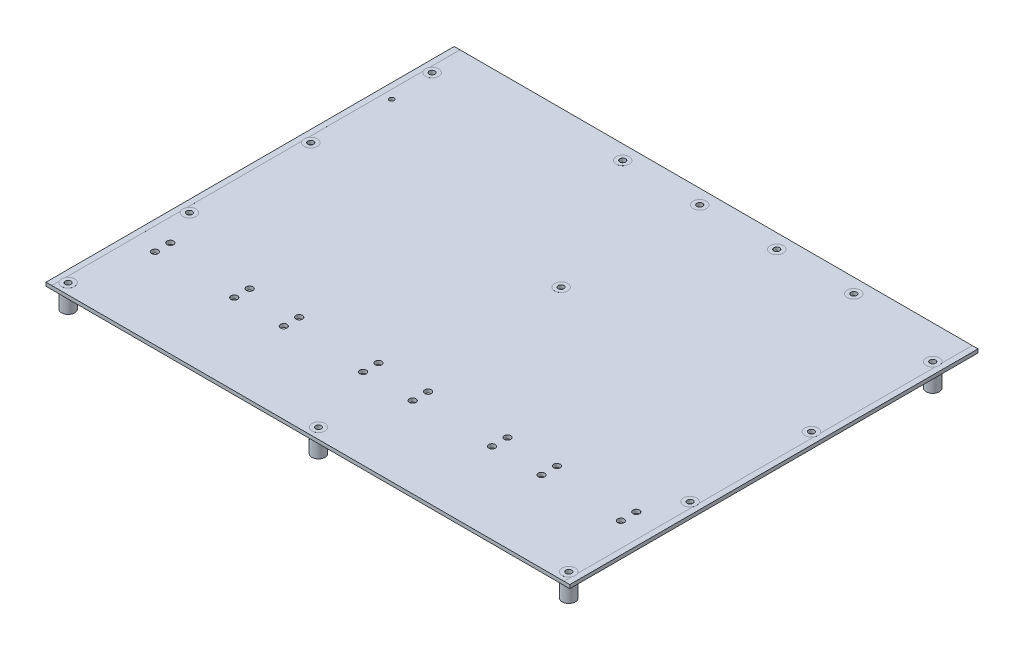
ISO-10303-21;
HEADER;
FILE_DESCRIPTION(('STEP AP214'),'2;1');
FILE_NAME('part.step','',(''),(''),'','','');
FILE_SCHEMA(('AUTOMOTIVE_DESIGN { 1 0 10303 214 1 1 1 1 }'));
ENDSEC;
DATA;
#1=APPLICATION_CONTEXT('core data for automotive mechanical design processes');
#2=APPLICATION_PROTOCOL_DEFINITION('international standard','automotive_design',2000,#1);
#3=PRODUCT_CONTEXT('',#1,'mechanical');
#4=PRODUCT('Part','Part','',(#3));
#5=PRODUCT_RELATED_PRODUCT_CATEGORY('part','',(#4));
#6=PRODUCT_DEFINITION_FORMATION('','',#4);
#7=PRODUCT_DEFINITION_CONTEXT('part definition',#1,'design');
#8=PRODUCT_DEFINITION('design','',#6,#7);
#9=PRODUCT_DEFINITION_SHAPE('','',#8);
#10=(LENGTH_UNIT() NAMED_UNIT(*) SI_UNIT(.MILLI.,.METRE.));
#11=(NAMED_UNIT(*) PLANE_ANGLE_UNIT() SI_UNIT($,.RADIAN.));
#12=(NAMED_UNIT(*) SI_UNIT($,.STERADIAN.) SOLID_ANGLE_UNIT());
#13=UNCERTAINTY_MEASURE_WITH_UNIT(LENGTH_MEASURE(1.E-05),#10,'distance_accuracy_value','');
#14=(GEOMETRIC_REPRESENTATION_CONTEXT(3) GLOBAL_UNCERTAINTY_ASSIGNED_CONTEXT((#13)) GLOBAL_UNIT_ASSIGNED_CONTEXT((#10,
#11,#12)) REPRESENTATION_CONTEXT('',''));
#15=CARTESIAN_POINT('',(0.,0.,0.));
#16=DIRECTION('',(0.,0.,1.));
#17=DIRECTION('',(1.,0.,0.));
#18=AXIS2_PLACEMENT_3D('',#15,#16,#17);
#19=CARTESIAN_POINT('',(-172.72,2.3622,0.));
#20=DIRECTION('',(0.,-1.,0.));
#21=DIRECTION('',(0.,0.,-1.));
#22=AXIS2_PLACEMENT_3D('',#19,#20,#21);
#23=PLANE('',#22);
#24=CARTESIAN_POINT('',(-163.195,2.3622,50.8));
#25=DIRECTION('',(0.,1.,0.));
#26=DIRECTION('',(0.,0.,1.));
#27=AXIS2_PLACEMENT_3D('',#24,#25,#26);
#28=CIRCLE('',#27,1.58749999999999);
#29=CARTESIAN_POINT('',(-163.195,2.3622,52.3874999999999));
#30=VERTEX_POINT('',#29);
#31=EDGE_CURVE('E2209',#30,#30,#28,.T.);
#32=ORIENTED_EDGE('',*,*,#31,.F.);
#33=EDGE_LOOP('',(#32));
#34=FACE_BOUND('',#33,.T.);
#35=CARTESIAN_POINT('',(49.53,2.3622,9.525));
#36=DIRECTION('',(0.,-1.,0.));
#37=DIRECTION('',(0.,0.,-1.));
#38=AXIS2_PLACEMENT_3D('',#35,#36,#37);
#39=CIRCLE('',#38,4.318);
#40=CARTESIAN_POINT('',(49.53,2.3622,5.207));
#41=VERTEX_POINT('',#40);
#42=EDGE_CURVE('E47',#41,#41,#39,.F.);
#43=ORIENTED_EDGE('',*,*,#42,.F.);
#44=EDGE_LOOP('',(#43));
#45=FACE_BOUND('',#44,.T.);
#46=CARTESIAN_POINT('',(-52.07,2.3622,9.525));
#47=DIRECTION('',(0.,-1.,0.));
#48=DIRECTION('',(0.,0.,-1.));
#49=AXIS2_PLACEMENT_3D('',#46,#47,#48);
#50=CIRCLE('',#49,4.318);
#51=CARTESIAN_POINT('',(-52.07,2.3622,5.207));
#52=VERTEX_POINT('',#51);
#53=EDGE_CURVE('E737',#52,#52,#50,.F.);
#54=ORIENTED_EDGE('',*,*,#53,.F.);
#55=EDGE_LOOP('',(#54));
#56=FACE_BOUND('',#55,.T.);
#57=CARTESIAN_POINT('',(153.1414,2.3622,205.779379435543));
#58=DIRECTION('',(0.,-1.,0.));
#59=DIRECTION('',(0.,0.,-1.));
#60=AXIS2_PLACEMENT_3D('',#57,#58,#59);
#61=CIRCLE('',#60,2.159);
#62=CARTESIAN_POINT('',(153.1414,2.3622,203.620379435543));
#63=VERTEX_POINT('',#62);
#64=EDGE_CURVE('E777',#63,#63,#61,.T.);
#65=ORIENTED_EDGE('',*,*,#64,.T.);
#66=EDGE_LOOP('',(#65));
#67=FACE_BOUND('',#66,.T.);
#68=CARTESIAN_POINT('',(153.1414,2.3622,215.939379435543));
#69=DIRECTION('',(0.,-1.,0.));
#70=DIRECTION('',(0.,0.,-1.));
#71=AXIS2_PLACEMENT_3D('',#68,#69,#70);
#72=CIRCLE('',#71,2.159);
#73=CARTESIAN_POINT('',(153.1414,2.3622,213.780379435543));
#74=VERTEX_POINT('',#73);
#75=EDGE_CURVE('E773',#74,#74,#72,.T.);
#76=ORIENTED_EDGE('',*,*,#75,.T.);
#77=EDGE_LOOP('',(#76));
#78=FACE_BOUND('',#77,.T.);
#79=CARTESIAN_POINT('',(100.8174,2.3622,205.779379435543));
#80=DIRECTION('',(0.,-1.,0.));
#81=DIRECTION('',(0.,0.,-1.));
#82=AXIS2_PLACEMENT_3D('',#79,#80,#81);
#83=CIRCLE('',#82,2.159);
#84=CARTESIAN_POINT('',(100.8174,2.3622,203.620379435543));
#85=VERTEX_POINT('',#84);
#86=EDGE_CURVE('E768',#85,#85,#83,.T.);
#87=ORIENTED_EDGE('',*,*,#86,.T.);
#88=EDGE_LOOP('',(#87));
#89=FACE_BOUND('',#88,.T.);
#90=CARTESIAN_POINT('',(100.8174,2.3622,215.939379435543));
#91=DIRECTION('',(0.,-1.,0.));
#92=DIRECTION('',(0.,0.,-1.));
#93=AXIS2_PLACEMENT_3D('',#90,#91,#92);
#94=CIRCLE('',#93,2.159);
#95=CARTESIAN_POINT('',(100.8174,2.3622,213.780379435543));
#96=VERTEX_POINT('',#95);
#97=EDGE_CURVE('E840',#96,#96,#94,.T.);
#98=ORIENTED_EDGE('',*,*,#97,.T.);
#99=EDGE_LOOP('',(#98));
#100=FACE_BOUND('',#99,.T.);
#101=CARTESIAN_POINT('',(68.1414,2.3622,205.779379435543));
#102=DIRECTION('',(0.,-1.,0.));
#103=DIRECTION('',(0.,0.,-1.));
#104=AXIS2_PLACEMENT_3D('',#101,#102,#103);
#105=CIRCLE('',#104,2.159);
#106=CARTESIAN_POINT('',(68.1414,2.3622,203.620379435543));
#107=VERTEX_POINT('',#106);
#108=EDGE_CURVE('E764',#107,#107,#105,.T.);
#109=ORIENTED_EDGE('',*,*,#108,.T.);
#110=EDGE_LOOP('',(#109));
#111=FACE_BOUND('',#110,.T.);
#112=CARTESIAN_POINT('',(68.1414,2.3622,215.939379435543));
#113=DIRECTION('',(0.,-1.,0.));
#114=DIRECTION('',(0.,0.,-1.));
#115=AXIS2_PLACEMENT_3D('',#112,#113,#114);
#116=CIRCLE('',#115,2.159);
#117=CARTESIAN_POINT('',(68.1414,2.3622,213.780379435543));
#118=VERTEX_POINT('',#117);
#119=EDGE_CURVE('E760',#118,#118,#116,.T.);
#120=ORIENTED_EDGE('',*,*,#119,.T.);
#121=EDGE_LOOP('',(#120));
#122=FACE_BOUND('',#121,.T.);
#123=CARTESIAN_POINT('',(15.8174,2.3622,205.779379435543));
#124=DIRECTION('',(0.,-1.,0.));
#125=DIRECTION('',(0.,0.,-1.));
#126=AXIS2_PLACEMENT_3D('',#123,#124,#125);
#127=CIRCLE('',#126,2.159);
#128=CARTESIAN_POINT('',(15.8174,2.3622,203.620379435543));
#129=VERTEX_POINT('',#128);
#130=EDGE_CURVE('E755',#129,#129,#127,.T.);
#131=ORIENTED_EDGE('',*,*,#130,.T.);
#132=EDGE_LOOP('',(#131));
#133=FACE_BOUND('',#132,.T.);
#134=CARTESIAN_POINT('',(15.8174,2.3622,215.939379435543));
#135=DIRECTION('',(0.,-1.,0.));
#136=DIRECTION('',(0.,0.,-1.));
#137=AXIS2_PLACEMENT_3D('',#134,#135,#136);
#138=CIRCLE('',#137,2.159);
#139=CARTESIAN_POINT('',(15.8174,2.3622,213.780379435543));
#140=VERTEX_POINT('',#139);
#141=EDGE_CURVE('E851',#140,#140,#138,.T.);
#142=ORIENTED_EDGE('',*,*,#141,.T.);
#143=EDGE_LOOP('',(#142));
#144=FACE_BOUND('',#143,.T.);
#145=CARTESIAN_POINT('',(-16.8586,2.3622,205.779379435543));
#146=DIRECTION('',(0.,-1.,0.));
#147=DIRECTION('',(0.,0.,-1.));
#148=AXIS2_PLACEMENT_3D('',#145,#146,#147);
#149=CIRCLE('',#148,2.159);
#150=CARTESIAN_POINT('',(-16.8586,2.3622,203.620379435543));
#151=VERTEX_POINT('',#150);
#152=EDGE_CURVE('E751',#151,#151,#149,.T.);
#153=ORIENTED_EDGE('',*,*,#152,.T.);
#154=EDGE_LOOP('',(#153));
#155=FACE_BOUND('',#154,.T.);
#156=CARTESIAN_POINT('',(-16.8586,2.3622,215.939379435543));
#157=DIRECTION('',(0.,-1.,0.));
#158=DIRECTION('',(0.,0.,-1.));
#159=AXIS2_PLACEMENT_3D('',#156,#157,#158);
#160=CIRCLE('',#159,2.159);
#161=CARTESIAN_POINT('',(-16.8586,2.3622,213.780379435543));
#162=VERTEX_POINT('',#161);
#163=EDGE_CURVE('E747',#162,#162,#160,.T.);
#164=ORIENTED_EDGE('',*,*,#163,.T.);
#165=EDGE_LOOP('',(#164));
#166=FACE_BOUND('',#165,.T.);
#167=CARTESIAN_POINT('',(-69.1826,2.3622,205.779379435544));
#168=DIRECTION('',(0.,-1.,0.));
#169=DIRECTION('',(0.,0.,-1.));
#170=AXIS2_PLACEMENT_3D('',#167,#168,#169);
#171=CIRCLE('',#170,2.159);
#172=CARTESIAN_POINT('',(-69.1826,2.3622,203.620379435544));
#173=VERTEX_POINT('',#172);
#174=EDGE_CURVE('E743',#173,#173,#171,.T.);
#175=ORIENTED_EDGE('',*,*,#174,.T.);
#176=EDGE_LOOP('',(#175));
#177=FACE_BOUND('',#176,.T.);
#178=CARTESIAN_POINT('',(-69.1826,2.3622,215.939379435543));
#179=DIRECTION('',(0.,-1.,0.));
#180=DIRECTION('',(0.,0.,-1.));
#181=AXIS2_PLACEMENT_3D('',#178,#179,#180);
#182=CIRCLE('',#181,2.159);
#183=CARTESIAN_POINT('',(-69.1826,2.3622,213.780379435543));
#184=VERTEX_POINT('',#183);
#185=EDGE_CURVE('E738',#184,#184,#182,.T.);
#186=ORIENTED_EDGE('',*,*,#185,.T.);
#187=EDGE_LOOP('',(#186));
#188=FACE_BOUND('',#187,.T.);
#189=CARTESIAN_POINT('',(-101.8586,2.3622,215.939379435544));
#190=DIRECTION('',(0.,-1.,0.));
#191=DIRECTION('',(0.,0.,-1.));
#192=AXIS2_PLACEMENT_3D('',#189,#190,#191);
#193=CIRCLE('',#192,2.159);
#194=CARTESIAN_POINT('',(-101.8586,2.3622,213.780379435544));
#195=VERTEX_POINT('',#194);
#196=EDGE_CURVE('E863',#195,#195,#193,.T.);
#197=ORIENTED_EDGE('',*,*,#196,.T.);
#198=EDGE_LOOP('',(#197));
#199=FACE_BOUND('',#198,.T.);
#200=CARTESIAN_POINT('',(-154.1826,2.3622,215.939379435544));
#201=DIRECTION('',(0.,-1.,0.));
#202=DIRECTION('',(0.,0.,-1.));
#203=AXIS2_PLACEMENT_3D('',#200,#201,#202);
#204=CIRCLE('',#203,2.159);
#205=CARTESIAN_POINT('',(-154.1826,2.3622,213.780379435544));
#206=VERTEX_POINT('',#205);
#207=EDGE_CURVE('E348',#206,#206,#204,.T.);
#208=ORIENTED_EDGE('',*,*,#207,.T.);
#209=EDGE_LOOP('',(#208));
#210=FACE_BOUND('',#209,.T.);
#211=CARTESIAN_POINT('',(0.,2.3622,102.235));
#212=DIRECTION('',(0.,-1.,0.));
#213=DIRECTION('',(0.,0.,-1.));
#214=AXIS2_PLACEMENT_3D('',#211,#212,#213);
#215=CIRCLE('',#214,4.318);
#216=CARTESIAN_POINT('',(0.,2.3622,97.917));
#217=VERTEX_POINT('',#216);
#218=EDGE_CURVE('E622',#217,#217,#215,.F.);
#219=ORIENTED_EDGE('',*,*,#218,.F.);
#220=EDGE_LOOP('',(#219));
#221=FACE_BOUND('',#220,.T.);
#222=CARTESIAN_POINT('',(0.,2.3622,262.255));
#223=DIRECTION('',(0.,-1.,0.));
#224=DIRECTION('',(0.,0.,-1.));
#225=AXIS2_PLACEMENT_3D('',#222,#223,#224);
#226=CIRCLE('',#225,4.318);
#227=CARTESIAN_POINT('',(0.,2.3622,257.937));
#228=VERTEX_POINT('',#227);
#229=EDGE_CURVE('E625',#228,#228,#226,.F.);
#230=ORIENTED_EDGE('',*,*,#229,.F.);
#231=EDGE_LOOP('',(#230));
#232=FACE_BOUND('',#231,.T.);
#233=DIRECTION('',(0.,0.,1.));
#234=VECTOR('',#233,1.);
#235=CARTESIAN_POINT('',(168.91,2.3622,0.));
#236=LINE('',#235,#234);
#237=CARTESIAN_POINT('',(168.91,2.3622,0.));
#238=VERTEX_POINT('',#237);
#239=CARTESIAN_POINT('',(168.91,2.3622,20.193));
#240=VERTEX_POINT('',#239);
#241=EDGE_CURVE('E397',#238,#240,#236,.T.);
#242=ORIENTED_EDGE('',*,*,#241,.F.);
#243=DIRECTION('',(-1.,0.,0.));
#244=VECTOR('',#243,1.);
#245=CARTESIAN_POINT('',(-172.72,2.3622,0.));
#246=LINE('',#245,#244);
#247=CARTESIAN_POINT('',(-168.91,2.3622,0.));
#248=VERTEX_POINT('',#247);
#249=EDGE_CURVE('E669',#238,#248,#246,.T.);
#250=ORIENTED_EDGE('',*,*,#249,.T.);
#251=DIRECTION('',(0.,0.,-1.));
#252=VECTOR('',#251,1.);
#253=CARTESIAN_POINT('',(-168.91,2.3622,0.));
#254=LINE('',#253,#252);
#255=CARTESIAN_POINT('',(-168.91,2.3622,20.193));
#256=VERTEX_POINT('',#255);
#257=EDGE_CURVE('E484',#256,#248,#254,.T.);
#258=ORIENTED_EDGE('',*,*,#257,.F.);
#259=CARTESIAN_POINT('',(-165.1,2.3622,22.225));
#260=DIRECTION('',(0.,-1.,0.));
#261=DIRECTION('',(0.,0.,-1.));
#262=AXIS2_PLACEMENT_3D('',#259,#260,#261);
#263=CIRCLE('',#262,4.318);
#264=CARTESIAN_POINT('',(-168.91,2.3622,24.257));
#265=VERTEX_POINT('',#264);
#266=EDGE_CURVE('E653',#265,#256,#263,.F.);
#267=ORIENTED_EDGE('',*,*,#266,.F.);
#268=CARTESIAN_POINT('',(-168.91,2.3622,100.203));
#269=VERTEX_POINT('',#268);
#270=EDGE_CURVE('E514',#269,#265,#254,.T.);
#271=ORIENTED_EDGE('',*,*,#270,.F.);
#272=CARTESIAN_POINT('',(-165.1,2.3622,102.235));
#273=DIRECTION('',(0.,-1.,0.));
#274=DIRECTION('',(0.,0.,-1.));
#275=AXIS2_PLACEMENT_3D('',#272,#273,#274);
#276=CIRCLE('',#275,4.318);
#277=CARTESIAN_POINT('',(-168.91,2.3622,104.267));
#278=VERTEX_POINT('',#277);
#279=EDGE_CURVE('E643',#278,#269,#276,.F.);
#280=ORIENTED_EDGE('',*,*,#279,.F.);
#281=CARTESIAN_POINT('',(-168.91,2.3622,180.213));
#282=VERTEX_POINT('',#281);
#283=EDGE_CURVE('E502',#282,#278,#254,.T.);
#284=ORIENTED_EDGE('',*,*,#283,.F.);
#285=CARTESIAN_POINT('',(-165.1,2.3622,182.245));
#286=DIRECTION('',(0.,-1.,0.));
#287=DIRECTION('',(0.,0.,-1.));
#288=AXIS2_PLACEMENT_3D('',#285,#286,#287);
#289=CIRCLE('',#288,4.318);
#290=CARTESIAN_POINT('',(-168.91,2.3622,184.277));
#291=VERTEX_POINT('',#290);
#292=EDGE_CURVE('E633',#291,#282,#289,.F.);
#293=ORIENTED_EDGE('',*,*,#292,.F.);
#294=CARTESIAN_POINT('',(-168.91,2.3622,260.223));
#295=VERTEX_POINT('',#294);
#296=EDGE_CURVE('E483',#295,#291,#254,.T.);
#297=ORIENTED_EDGE('',*,*,#296,.F.);
#298=CARTESIAN_POINT('',(-165.1,2.3622,262.255));
#299=DIRECTION('',(0.,-1.,0.));
#300=DIRECTION('',(0.,0.,-1.));
#301=AXIS2_PLACEMENT_3D('',#298,#299,#300);
#302=CIRCLE('',#301,4.318);
#303=CARTESIAN_POINT('',(-168.91,2.3622,264.287));
#304=VERTEX_POINT('',#303);
#305=EDGE_CURVE('E626',#304,#295,#302,.F.);
#306=ORIENTED_EDGE('',*,*,#305,.F.);
#307=CARTESIAN_POINT('',(-168.91,2.3622,269.24));
#308=VERTEX_POINT('',#307);
#309=EDGE_CURVE('E481',#308,#304,#254,.T.);
#310=ORIENTED_EDGE('',*,*,#309,.F.);
#311=DIRECTION('',(1.,0.,0.));
#312=VECTOR('',#311,1.);
#313=CARTESIAN_POINT('',(-172.72,2.3622,269.24));
#314=LINE('',#313,#312);
#315=CARTESIAN_POINT('',(168.91,2.3622,269.24));
#316=VERTEX_POINT('',#315);
#317=EDGE_CURVE('E666',#308,#316,#314,.T.);
#318=ORIENTED_EDGE('',*,*,#317,.T.);
#319=CARTESIAN_POINT('',(168.91,2.3622,264.287));
#320=VERTEX_POINT('',#319);
#321=EDGE_CURVE('E398',#320,#316,#236,.T.);
#322=ORIENTED_EDGE('',*,*,#321,.F.);
#323=CARTESIAN_POINT('',(165.1,2.3622,262.255));
#324=DIRECTION('',(0.,-1.,0.));
#325=DIRECTION('',(0.,0.,-1.));
#326=AXIS2_PLACEMENT_3D('',#323,#324,#325);
#327=CIRCLE('',#326,4.318);
#328=CARTESIAN_POINT('',(168.91,2.3622,260.223));
#329=VERTEX_POINT('',#328);
#330=EDGE_CURVE('E699',#329,#320,#327,.F.);
#331=ORIENTED_EDGE('',*,*,#330,.F.);
#332=CARTESIAN_POINT('',(168.91,2.3622,184.277));
#333=VERTEX_POINT('',#332);
#334=EDGE_CURVE('E394',#333,#329,#236,.T.);
#335=ORIENTED_EDGE('',*,*,#334,.F.);
#336=CARTESIAN_POINT('',(165.1,2.3622,182.245));
#337=DIRECTION('',(0.,-1.,0.));
#338=DIRECTION('',(0.,0.,-1.));
#339=AXIS2_PLACEMENT_3D('',#336,#337,#338);
#340=CIRCLE('',#339,4.318);
#341=CARTESIAN_POINT('',(168.91,2.3622,180.213));
#342=VERTEX_POINT('',#341);
#343=EDGE_CURVE('E696',#342,#333,#340,.F.);
#344=ORIENTED_EDGE('',*,*,#343,.F.);
#345=CARTESIAN_POINT('',(168.91,2.3622,104.267));
#346=VERTEX_POINT('',#345);
#347=EDGE_CURVE('E411',#346,#342,#236,.T.);
#348=ORIENTED_EDGE('',*,*,#347,.F.);
#349=CARTESIAN_POINT('',(165.1,2.3622,102.235));
#350=DIRECTION('',(0.,-1.,0.));
#351=DIRECTION('',(0.,0.,-1.));
#352=AXIS2_PLACEMENT_3D('',#349,#350,#351);
#353=CIRCLE('',#352,4.318);
#354=CARTESIAN_POINT('',(168.91,2.3622,100.203));
#355=VERTEX_POINT('',#354);
#356=EDGE_CURVE('E693',#355,#346,#353,.F.);
#357=ORIENTED_EDGE('',*,*,#356,.F.);
#358=CARTESIAN_POINT('',(168.91,2.3622,24.257));
#359=VERTEX_POINT('',#358);
#360=EDGE_CURVE('E423',#359,#355,#236,.T.);
#361=ORIENTED_EDGE('',*,*,#360,.F.);
#362=CARTESIAN_POINT('',(165.1,2.3622,22.225));
#363=DIRECTION('',(0.,-1.,0.));
#364=DIRECTION('',(0.,0.,-1.));
#365=AXIS2_PLACEMENT_3D('',#362,#363,#364);
#366=CIRCLE('',#365,4.318);
#367=EDGE_CURVE('E690',#240,#359,#366,.F.);
#368=ORIENTED_EDGE('',*,*,#367,.F.);
#369=EDGE_LOOP('',(#242,#250,#258,#267,#271,#280,#284,#293,#297,#306,#310,#318,#322,#331,#335,
#344,#348,#357,#361,#368));
#370=FACE_BOUND('',#369,.T.);
#371=CARTESIAN_POINT('',(-154.1826,2.3622,205.779379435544));
#372=DIRECTION('',(0.,-1.,0.));
#373=DIRECTION('',(0.,0.,-1.));
#374=AXIS2_PLACEMENT_3D('',#371,#372,#373);
#375=CIRCLE('',#374,2.159);
#376=CARTESIAN_POINT('',(-154.1826,2.3622,203.620379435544));
#377=VERTEX_POINT('',#376);
#378=EDGE_CURVE('E728',#377,#377,#375,.T.);
#379=ORIENTED_EDGE('',*,*,#378,.T.);
#380=EDGE_LOOP('',(#379));
#381=FACE_BOUND('',#380,.T.);
#382=CARTESIAN_POINT('',(-101.8586,2.3622,205.779379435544));
#383=DIRECTION('',(0.,-1.,0.));
#384=DIRECTION('',(0.,0.,-1.));
#385=AXIS2_PLACEMENT_3D('',#382,#383,#384);
#386=CIRCLE('',#385,2.159);
#387=CARTESIAN_POINT('',(-101.8586,2.3622,203.620379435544));
#388=VERTEX_POINT('',#387);
#389=EDGE_CURVE('E734',#388,#388,#386,.T.);
#390=ORIENTED_EDGE('',*,*,#389,.T.);
#391=EDGE_LOOP('',(#390));
#392=FACE_BOUND('',#391,.T.);
#393=CARTESIAN_POINT('',(-1.27,2.3622,9.525));
#394=DIRECTION('',(0.,-1.,0.));
#395=DIRECTION('',(0.,0.,-1.));
#396=AXIS2_PLACEMENT_3D('',#393,#394,#395);
#397=CIRCLE('',#396,4.318);
#398=CARTESIAN_POINT('',(-1.27,2.3622,5.207));
#399=VERTEX_POINT('',#398);
#400=EDGE_CURVE('E783',#399,#399,#397,.F.);
#401=ORIENTED_EDGE('',*,*,#400,.F.);
#402=EDGE_LOOP('',(#401));
#403=FACE_BOUND('',#402,.T.);
#404=CARTESIAN_POINT('',(100.33,2.3622,9.525));
#405=DIRECTION('',(0.,-1.,0.));
#406=DIRECTION('',(0.,0.,-1.));
#407=AXIS2_PLACEMENT_3D('',#404,#405,#406);
#408=CIRCLE('',#407,4.318);
#409=CARTESIAN_POINT('',(100.33,2.3622,5.207));
#410=VERTEX_POINT('',#409);
#411=EDGE_CURVE('E11',#410,#410,#408,.F.);
#412=ORIENTED_EDGE('',*,*,#411,.F.);
#413=EDGE_LOOP('',(#412));
#414=FACE_BOUND('',#413,.T.);
#415=ADVANCED_FACE('F38',(#34,#45,#56,#67,#78,#89,#100,#111,#122,#133,#144,#155,#166,#177,#188,
#199,#210,#221,#232,#370,#381,#392,#403,#414),#23,.F.);
#416=CARTESIAN_POINT('',(-172.72,0.,0.));
#417=DIRECTION('',(0.,-1.,0.));
#418=DIRECTION('',(0.,0.,-1.));
#419=AXIS2_PLACEMENT_3D('',#416,#417,#418);
#420=PLANE('',#419);
#421=CARTESIAN_POINT('',(-163.195,0.,50.8));
#422=DIRECTION('',(0.,-1.,0.));
#423=DIRECTION('',(0.,0.,-1.));
#424=AXIS2_PLACEMENT_3D('',#421,#422,#423);
#425=CIRCLE('',#424,1.58749999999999);
#426=CARTESIAN_POINT('',(-163.195,0.,49.2125));
#427=VERTEX_POINT('',#426);
#428=EDGE_CURVE('E42',#427,#427,#425,.T.);
#429=ORIENTED_EDGE('',*,*,#428,.F.);
#430=EDGE_LOOP('',(#429));
#431=FACE_BOUND('',#430,.T.);
#432=CARTESIAN_POINT('',(49.53,0.,9.525));
#433=DIRECTION('',(0.,-1.,0.));
#434=DIRECTION('',(0.,0.,-1.));
#435=AXIS2_PLACEMENT_3D('',#432,#433,#434);
#436=CIRCLE('',#435,4.318);
#437=CARTESIAN_POINT('',(49.53,0.,5.207));
#438=VERTEX_POINT('',#437);
#439=EDGE_CURVE('E789',#438,#438,#436,.F.);
#440=ORIENTED_EDGE('',*,*,#439,.T.);
#441=EDGE_LOOP('',(#440));
#442=FACE_BOUND('',#441,.T.);
#443=CARTESIAN_POINT('',(-52.07,0.,9.525));
#444=DIRECTION('',(0.,-1.,0.));
#445=DIRECTION('',(0.,0.,-1.));
#446=AXIS2_PLACEMENT_3D('',#443,#444,#445);
#447=CIRCLE('',#446,4.318);
#448=CARTESIAN_POINT('',(-52.07,0.,5.207));
#449=VERTEX_POINT('',#448);
#450=EDGE_CURVE('E829',#449,#449,#447,.F.);
#451=ORIENTED_EDGE('',*,*,#450,.T.);
#452=EDGE_LOOP('',(#451));
#453=FACE_BOUND('',#452,.T.);
#454=CARTESIAN_POINT('',(153.1414,0.,205.779379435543));
#455=DIRECTION('',(0.,-1.,0.));
#456=DIRECTION('',(0.,0.,-1.));
#457=AXIS2_PLACEMENT_3D('',#454,#455,#456);
#458=CIRCLE('',#457,2.159);
#459=CARTESIAN_POINT('',(153.1414,0.,203.620379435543));
#460=VERTEX_POINT('',#459);
#461=EDGE_CURVE('E780',#460,#460,#458,.T.);
#462=ORIENTED_EDGE('',*,*,#461,.F.);
#463=EDGE_LOOP('',(#462));
#464=FACE_BOUND('',#463,.T.);
#465=CARTESIAN_POINT('',(153.1414,0.,215.939379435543));
#466=DIRECTION('',(0.,-1.,0.));
#467=DIRECTION('',(0.,0.,-1.));
#468=AXIS2_PLACEMENT_3D('',#465,#466,#467);
#469=CIRCLE('',#468,2.159);
#470=CARTESIAN_POINT('',(153.1414,0.,213.780379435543));
#471=VERTEX_POINT('',#470);
#472=EDGE_CURVE('E776',#471,#471,#469,.T.);
#473=ORIENTED_EDGE('',*,*,#472,.F.);
#474=EDGE_LOOP('',(#473));
#475=FACE_BOUND('',#474,.T.);
#476=CARTESIAN_POINT('',(100.8174,0.,205.779379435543));
#477=DIRECTION('',(0.,-1.,0.));
#478=DIRECTION('',(0.,0.,-1.));
#479=AXIS2_PLACEMENT_3D('',#476,#477,#478);
#480=CIRCLE('',#479,2.159);
#481=CARTESIAN_POINT('',(100.8174,0.,203.620379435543));
#482=VERTEX_POINT('',#481);
#483=EDGE_CURVE('E772',#482,#482,#480,.T.);
#484=ORIENTED_EDGE('',*,*,#483,.F.);
#485=EDGE_LOOP('',(#484));
#486=FACE_BOUND('',#485,.T.);
#487=CARTESIAN_POINT('',(100.8174,0.,215.939379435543));
#488=DIRECTION('',(0.,-1.,0.));
#489=DIRECTION('',(0.,0.,-1.));
#490=AXIS2_PLACEMENT_3D('',#487,#488,#489);
#491=CIRCLE('',#490,2.159);
#492=CARTESIAN_POINT('',(100.8174,0.,213.780379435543));
#493=VERTEX_POINT('',#492);
#494=EDGE_CURVE('E771',#493,#493,#491,.T.);
#495=ORIENTED_EDGE('',*,*,#494,.F.);
#496=EDGE_LOOP('',(#495));
#497=FACE_BOUND('',#496,.T.);
#498=CARTESIAN_POINT('',(68.1414,0.,205.779379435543));
#499=DIRECTION('',(0.,-1.,0.));
#500=DIRECTION('',(0.,0.,-1.));
#501=AXIS2_PLACEMENT_3D('',#498,#499,#500);
#502=CIRCLE('',#501,2.159);
#503=CARTESIAN_POINT('',(68.1414,0.,203.620379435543));
#504=VERTEX_POINT('',#503);
#505=EDGE_CURVE('E767',#504,#504,#502,.T.);
#506=ORIENTED_EDGE('',*,*,#505,.F.);
#507=EDGE_LOOP('',(#506));
#508=FACE_BOUND('',#507,.T.);
#509=CARTESIAN_POINT('',(68.1414,0.,215.939379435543));
#510=DIRECTION('',(0.,-1.,0.));
#511=DIRECTION('',(0.,0.,-1.));
#512=AXIS2_PLACEMENT_3D('',#509,#510,#511);
#513=CIRCLE('',#512,2.159);
#514=CARTESIAN_POINT('',(68.1414,0.,213.780379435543));
#515=VERTEX_POINT('',#514);
#516=EDGE_CURVE('E763',#515,#515,#513,.T.);
#517=ORIENTED_EDGE('',*,*,#516,.F.);
#518=EDGE_LOOP('',(#517));
#519=FACE_BOUND('',#518,.T.);
#520=CARTESIAN_POINT('',(15.8174,0.,205.779379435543));
#521=DIRECTION('',(0.,-1.,0.));
#522=DIRECTION('',(0.,0.,-1.));
#523=AXIS2_PLACEMENT_3D('',#520,#521,#522);
#524=CIRCLE('',#523,2.159);
#525=CARTESIAN_POINT('',(15.8174,0.,203.620379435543));
#526=VERTEX_POINT('',#525);
#527=EDGE_CURVE('E759',#526,#526,#524,.T.);
#528=ORIENTED_EDGE('',*,*,#527,.F.);
#529=EDGE_LOOP('',(#528));
#530=FACE_BOUND('',#529,.T.);
#531=CARTESIAN_POINT('',(15.8174,0.,215.939379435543));
#532=DIRECTION('',(0.,-1.,0.));
#533=DIRECTION('',(0.,0.,-1.));
#534=AXIS2_PLACEMENT_3D('',#531,#532,#533);
#535=CIRCLE('',#534,2.159);
#536=CARTESIAN_POINT('',(15.8174,0.,213.780379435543));
#537=VERTEX_POINT('',#536);
#538=EDGE_CURVE('E758',#537,#537,#535,.T.);
#539=ORIENTED_EDGE('',*,*,#538,.F.);
#540=EDGE_LOOP('',(#539));
#541=FACE_BOUND('',#540,.T.);
#542=CARTESIAN_POINT('',(-16.8586,0.,205.779379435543));
#543=DIRECTION('',(0.,-1.,0.));
#544=DIRECTION('',(0.,0.,-1.));
#545=AXIS2_PLACEMENT_3D('',#542,#543,#544);
#546=CIRCLE('',#545,2.159);
#547=CARTESIAN_POINT('',(-16.8586,0.,203.620379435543));
#548=VERTEX_POINT('',#547);
#549=EDGE_CURVE('E754',#548,#548,#546,.T.);
#550=ORIENTED_EDGE('',*,*,#549,.F.);
#551=EDGE_LOOP('',(#550));
#552=FACE_BOUND('',#551,.T.);
#553=CARTESIAN_POINT('',(-16.8586,0.,215.939379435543));
#554=DIRECTION('',(0.,-1.,0.));
#555=DIRECTION('',(0.,0.,-1.));
#556=AXIS2_PLACEMENT_3D('',#553,#554,#555);
#557=CIRCLE('',#556,2.159);
#558=CARTESIAN_POINT('',(-16.8586,0.,213.780379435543));
#559=VERTEX_POINT('',#558);
#560=EDGE_CURVE('E750',#559,#559,#557,.T.);
#561=ORIENTED_EDGE('',*,*,#560,.F.);
#562=EDGE_LOOP('',(#561));
#563=FACE_BOUND('',#562,.T.);
#564=CARTESIAN_POINT('',(-69.1826,0.,205.779379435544));
#565=DIRECTION('',(0.,-1.,0.));
#566=DIRECTION('',(0.,0.,-1.));
#567=AXIS2_PLACEMENT_3D('',#564,#565,#566);
#568=CIRCLE('',#567,2.159);
#569=CARTESIAN_POINT('',(-69.1826,0.,203.620379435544));
#570=VERTEX_POINT('',#569);
#571=EDGE_CURVE('E746',#570,#570,#568,.T.);
#572=ORIENTED_EDGE('',*,*,#571,.F.);
#573=EDGE_LOOP('',(#572));
#574=FACE_BOUND('',#573,.T.);
#575=CARTESIAN_POINT('',(-69.1826,0.,215.939379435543));
#576=DIRECTION('',(0.,-1.,0.));
#577=DIRECTION('',(0.,0.,-1.));
#578=AXIS2_PLACEMENT_3D('',#575,#576,#577);
#579=CIRCLE('',#578,2.159);
#580=CARTESIAN_POINT('',(-69.1826,0.,213.780379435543));
#581=VERTEX_POINT('',#580);
#582=EDGE_CURVE('E742',#581,#581,#579,.T.);
#583=ORIENTED_EDGE('',*,*,#582,.F.);
#584=EDGE_LOOP('',(#583));
#585=FACE_BOUND('',#584,.T.);
#586=CARTESIAN_POINT('',(-101.8586,0.,215.939379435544));
#587=DIRECTION('',(0.,-1.,0.));
#588=DIRECTION('',(0.,0.,-1.));
#589=AXIS2_PLACEMENT_3D('',#586,#587,#588);
#590=CIRCLE('',#589,2.159);
#591=CARTESIAN_POINT('',(-101.8586,0.,213.780379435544));
#592=VERTEX_POINT('',#591);
#593=EDGE_CURVE('E741',#592,#592,#590,.T.);
#594=ORIENTED_EDGE('',*,*,#593,.F.);
#595=EDGE_LOOP('',(#594));
#596=FACE_BOUND('',#595,.T.);
#597=CARTESIAN_POINT('',(-154.1826,0.,215.939379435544));
#598=DIRECTION('',(0.,-1.,0.));
#599=DIRECTION('',(0.,0.,-1.));
#600=AXIS2_PLACEMENT_3D('',#597,#598,#599);
#601=CIRCLE('',#600,2.159);
#602=CARTESIAN_POINT('',(-154.1826,0.,213.780379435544));
#603=VERTEX_POINT('',#602);
#604=EDGE_CURVE('E353',#603,#603,#601,.T.);
#605=ORIENTED_EDGE('',*,*,#604,.F.);
#606=EDGE_LOOP('',(#605));
#607=FACE_BOUND('',#606,.T.);
#608=CARTESIAN_POINT('',(0.,0.,102.235));
#609=DIRECTION('',(0.,-1.,0.));
#610=DIRECTION('',(0.,0.,-1.));
#611=AXIS2_PLACEMENT_3D('',#608,#609,#610);
#612=CIRCLE('',#611,4.318);
#613=CARTESIAN_POINT('',(0.,0.,97.917));
#614=VERTEX_POINT('',#613);
#615=EDGE_CURVE('E621',#614,#614,#612,.F.);
#616=ORIENTED_EDGE('',*,*,#615,.T.);
#617=EDGE_LOOP('',(#616));
#618=FACE_BOUND('',#617,.T.);
#619=CARTESIAN_POINT('',(0.,0.,262.255));
#620=DIRECTION('',(0.,-1.,0.));
#621=DIRECTION('',(0.,0.,-1.));
#622=AXIS2_PLACEMENT_3D('',#619,#620,#621);
#623=CIRCLE('',#622,4.318);
#624=CARTESIAN_POINT('',(0.,0.,257.937));
#625=VERTEX_POINT('',#624);
#626=EDGE_CURVE('E612',#625,#625,#623,.F.);
#627=ORIENTED_EDGE('',*,*,#626,.T.);
#628=EDGE_LOOP('',(#627));
#629=FACE_BOUND('',#628,.T.);
#630=DIRECTION('',(-1.,0.,0.));
#631=VECTOR('',#630,1.);
#632=CARTESIAN_POINT('',(-172.72,0.,0.));
#633=LINE('',#632,#631);
#634=CARTESIAN_POINT('',(168.91,0.,0.));
#635=VERTEX_POINT('',#634);
#636=CARTESIAN_POINT('',(-168.91,0.,0.));
#637=VERTEX_POINT('',#636);
#638=EDGE_CURVE('E62',#635,#637,#633,.T.);
#639=ORIENTED_EDGE('',*,*,#638,.F.);
#640=DIRECTION('',(0.,0.,1.));
#641=VECTOR('',#640,1.);
#642=CARTESIAN_POINT('',(168.91,0.,0.));
#643=LINE('',#642,#641);
#644=CARTESIAN_POINT('',(168.91,0.,20.193));
#645=VERTEX_POINT('',#644);
#646=EDGE_CURVE('E326',#635,#645,#643,.T.);
#647=ORIENTED_EDGE('',*,*,#646,.T.);
#648=CARTESIAN_POINT('',(165.1,0.,22.225));
#649=DIRECTION('',(0.,-1.,0.));
#650=DIRECTION('',(0.,0.,-1.));
#651=AXIS2_PLACEMENT_3D('',#648,#649,#650);
#652=CIRCLE('',#651,4.318);
#653=CARTESIAN_POINT('',(168.91,0.,24.257));
#654=VERTEX_POINT('',#653);
#655=EDGE_CURVE('E606',#645,#654,#652,.F.);
#656=ORIENTED_EDGE('',*,*,#655,.T.);
#657=CARTESIAN_POINT('',(168.91,0.,100.203));
#658=VERTEX_POINT('',#657);
#659=EDGE_CURVE('E417',#654,#658,#643,.T.);
#660=ORIENTED_EDGE('',*,*,#659,.T.);
#661=CARTESIAN_POINT('',(165.1,0.,102.235));
#662=DIRECTION('',(0.,-1.,0.));
#663=DIRECTION('',(0.,0.,-1.));
#664=AXIS2_PLACEMENT_3D('',#661,#662,#663);
#665=CIRCLE('',#664,4.318);
#666=CARTESIAN_POINT('',(168.91,0.,104.267));
#667=VERTEX_POINT('',#666);
#668=EDGE_CURVE('E600',#658,#667,#665,.F.);
#669=ORIENTED_EDGE('',*,*,#668,.T.);
#670=CARTESIAN_POINT('',(168.91,0.,180.213));
#671=VERTEX_POINT('',#670);
#672=EDGE_CURVE('E405',#667,#671,#643,.T.);
#673=ORIENTED_EDGE('',*,*,#672,.T.);
#674=CARTESIAN_POINT('',(165.1,0.,182.245));
#675=DIRECTION('',(0.,-1.,0.));
#676=DIRECTION('',(0.,0.,-1.));
#677=AXIS2_PLACEMENT_3D('',#674,#675,#676);
#678=CIRCLE('',#677,4.318);
#679=CARTESIAN_POINT('',(168.91,0.,184.277));
#680=VERTEX_POINT('',#679);
#681=EDGE_CURVE('E591',#671,#680,#678,.F.);
#682=ORIENTED_EDGE('',*,*,#681,.T.);
#683=CARTESIAN_POINT('',(168.91,0.,260.223));
#684=VERTEX_POINT('',#683);
#685=EDGE_CURVE('E386',#680,#684,#643,.T.);
#686=ORIENTED_EDGE('',*,*,#685,.T.);
#687=CARTESIAN_POINT('',(165.1,0.,262.255));
#688=DIRECTION('',(0.,-1.,0.));
#689=DIRECTION('',(0.,0.,-1.));
#690=AXIS2_PLACEMENT_3D('',#687,#688,#689);
#691=CIRCLE('',#690,4.318);
#692=CARTESIAN_POINT('',(168.91,0.,264.287));
#693=VERTEX_POINT('',#692);
#694=EDGE_CURVE('E583',#684,#693,#691,.F.);
#695=ORIENTED_EDGE('',*,*,#694,.T.);
#696=CARTESIAN_POINT('',(168.91,0.,269.24));
#697=VERTEX_POINT('',#696);
#698=EDGE_CURVE('E55',#693,#697,#643,.T.);
#699=ORIENTED_EDGE('',*,*,#698,.T.);
#700=DIRECTION('',(1.,0.,0.));
#701=VECTOR('',#700,1.);
#702=CARTESIAN_POINT('',(-172.72,0.,269.24));
#703=LINE('',#702,#701);
#704=CARTESIAN_POINT('',(-168.91,0.,269.24));
#705=VERTEX_POINT('',#704);
#706=EDGE_CURVE('E663',#705,#697,#703,.T.);
#707=ORIENTED_EDGE('',*,*,#706,.F.);
#708=DIRECTION('',(0.,0.,-1.));
#709=VECTOR('',#708,1.);
#710=CARTESIAN_POINT('',(-168.91,0.,0.));
#711=LINE('',#710,#709);
#712=CARTESIAN_POINT('',(-168.91,0.,264.287));
#713=VERTEX_POINT('',#712);
#714=EDGE_CURVE('E490',#705,#713,#711,.T.);
#715=ORIENTED_EDGE('',*,*,#714,.T.);
#716=CARTESIAN_POINT('',(-165.1,0.,262.255));
#717=DIRECTION('',(0.,-1.,0.));
#718=DIRECTION('',(0.,0.,-1.));
#719=AXIS2_PLACEMENT_3D('',#716,#717,#718);
#720=CIRCLE('',#719,4.318);
#721=CARTESIAN_POINT('',(-168.91,0.,260.223));
#722=VERTEX_POINT('',#721);
#723=EDGE_CURVE('E630',#713,#722,#720,.F.);
#724=ORIENTED_EDGE('',*,*,#723,.T.);
#725=CARTESIAN_POINT('',(-168.91,0.,184.277));
#726=VERTEX_POINT('',#725);
#727=EDGE_CURVE('E494',#722,#726,#711,.T.);
#728=ORIENTED_EDGE('',*,*,#727,.T.);
#729=CARTESIAN_POINT('',(-165.1,0.,182.245));
#730=DIRECTION('',(0.,-1.,0.));
#731=DIRECTION('',(0.,0.,-1.));
#732=AXIS2_PLACEMENT_3D('',#729,#730,#731);
#733=CIRCLE('',#732,4.318);
#734=CARTESIAN_POINT('',(-168.91,0.,180.213));
#735=VERTEX_POINT('',#734);
#736=EDGE_CURVE('E640',#726,#735,#733,.F.);
#737=ORIENTED_EDGE('',*,*,#736,.T.);
#738=CARTESIAN_POINT('',(-168.91,0.,104.267));
#739=VERTEX_POINT('',#738);
#740=EDGE_CURVE('E508',#735,#739,#711,.T.);
#741=ORIENTED_EDGE('',*,*,#740,.T.);
#742=CARTESIAN_POINT('',(-165.1,0.,102.235));
#743=DIRECTION('',(0.,-1.,0.));
#744=DIRECTION('',(0.,0.,-1.));
#745=AXIS2_PLACEMENT_3D('',#742,#743,#744);
#746=CIRCLE('',#745,4.318);
#747=CARTESIAN_POINT('',(-168.91,0.,100.203));
#748=VERTEX_POINT('',#747);
#749=EDGE_CURVE('E650',#739,#748,#746,.F.);
#750=ORIENTED_EDGE('',*,*,#749,.T.);
#751=CARTESIAN_POINT('',(-168.91,0.,24.257));
#752=VERTEX_POINT('',#751);
#753=EDGE_CURVE('E520',#748,#752,#711,.T.);
#754=ORIENTED_EDGE('',*,*,#753,.T.);
#755=CARTESIAN_POINT('',(-165.1,0.,22.225));
#756=DIRECTION('',(0.,-1.,0.));
#757=DIRECTION('',(0.,0.,-1.));
#758=AXIS2_PLACEMENT_3D('',#755,#756,#757);
#759=CIRCLE('',#758,4.318);
#760=CARTESIAN_POINT('',(-168.91,0.,20.193));
#761=VERTEX_POINT('',#760);
#762=EDGE_CURVE('E660',#752,#761,#759,.F.);
#763=ORIENTED_EDGE('',*,*,#762,.T.);
#764=EDGE_CURVE('E493',#761,#637,#711,.T.);
#765=ORIENTED_EDGE('',*,*,#764,.T.);
#766=EDGE_LOOP('',(#639,#647,#656,#660,#669,#673,#682,#686,#695,#699,#707,#715,#724,#728,#737,
#741,#750,#754,#763,#765));
#767=FACE_BOUND('',#766,.T.);
#768=CARTESIAN_POINT('',(-154.1826,0.,205.779379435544));
#769=DIRECTION('',(0.,-1.,0.));
#770=DIRECTION('',(0.,0.,-1.));
#771=AXIS2_PLACEMENT_3D('',#768,#769,#770);
#772=CIRCLE('',#771,2.159);
#773=CARTESIAN_POINT('',(-154.1826,0.,203.620379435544));
#774=VERTEX_POINT('',#773);
#775=EDGE_CURVE('E724',#774,#774,#772,.T.);
#776=ORIENTED_EDGE('',*,*,#775,.F.);
#777=EDGE_LOOP('',(#776));
#778=FACE_BOUND('',#777,.T.);
#779=CARTESIAN_POINT('',(-101.8586,0.,205.779379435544));
#780=DIRECTION('',(0.,-1.,0.));
#781=DIRECTION('',(0.,0.,-1.));
#782=AXIS2_PLACEMENT_3D('',#779,#780,#781);
#783=CIRCLE('',#782,2.159);
#784=CARTESIAN_POINT('',(-101.8586,0.,203.620379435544));
#785=VERTEX_POINT('',#784);
#786=EDGE_CURVE('E731',#785,#785,#783,.T.);
#787=ORIENTED_EDGE('',*,*,#786,.F.);
#788=EDGE_LOOP('',(#787));
#789=FACE_BOUND('',#788,.T.);
#790=CARTESIAN_POINT('',(-1.27,0.,9.525));
#791=DIRECTION('',(0.,-1.,0.));
#792=DIRECTION('',(0.,0.,-1.));
#793=AXIS2_PLACEMENT_3D('',#790,#791,#792);
#794=CIRCLE('',#793,4.318);
#795=CARTESIAN_POINT('',(-1.27,0.,5.207));
#796=VERTEX_POINT('',#795);
#797=EDGE_CURVE('E784',#796,#796,#794,.F.);
#798=ORIENTED_EDGE('',*,*,#797,.T.);
#799=EDGE_LOOP('',(#798));
#800=FACE_BOUND('',#799,.T.);
#801=CARTESIAN_POINT('',(100.33,0.,9.525));
#802=DIRECTION('',(0.,-1.,0.));
#803=DIRECTION('',(0.,0.,-1.));
#804=AXIS2_PLACEMENT_3D('',#801,#802,#803);
#805=CIRCLE('',#804,4.318);
#806=CARTESIAN_POINT('',(100.33,0.,5.207));
#807=VERTEX_POINT('',#806);
#808=EDGE_CURVE('E792',#807,#807,#805,.F.);
#809=ORIENTED_EDGE('',*,*,#808,.T.);
#810=EDGE_LOOP('',(#809));
#811=FACE_BOUND('',#810,.T.);
#812=ADVANCED_FACE('F873',(#431,#442,#453,#464,#475,#486,#497,#508,#519,#530,#541,#552,#563,
#574,#585,#596,#607,#618,#629,#767,#778,#789,#800,#811),#420,.T.);
#813=CARTESIAN_POINT('',(165.1,2.3749,22.225));
#814=DIRECTION('',(0.,-1.,0.));
#815=DIRECTION('',(0.,0.,-1.));
#816=AXIS2_PLACEMENT_3D('',#813,#814,#815);
#817=CYLINDRICAL_SURFACE('',#816,4.318);
#818=CARTESIAN_POINT('',(165.1,2.3749,22.225));
#819=DIRECTION('',(0.,1.,0.));
#820=DIRECTION('',(0.,0.,1.));
#821=AXIS2_PLACEMENT_3D('',#818,#819,#820);
#822=CIRCLE('',#821,4.318);
#823=CARTESIAN_POINT('',(165.1,2.3749,26.543));
#824=VERTEX_POINT('',#823);
#825=EDGE_CURVE('E603',#824,#824,#822,.T.);
#826=ORIENTED_EDGE('',*,*,#825,.F.);
#827=EDGE_LOOP('',(#826));
#828=FACE_BOUND('',#827,.T.);
#829=DIRECTION('',(0.,-1.,0.));
#830=VECTOR('',#829,1.);
#831=CARTESIAN_POINT('',(168.91,2.3749,24.257));
#832=LINE('',#831,#830);
#833=CARTESIAN_POINT('',(168.91,2.36347,24.257));
#834=VERTEX_POINT('',#833);
#835=EDGE_CURVE('E424',#834,#359,#832,.T.);
#836=ORIENTED_EDGE('',*,*,#835,.F.);
#837=CARTESIAN_POINT('',(165.1,2.36347,22.225));
#838=DIRECTION('',(0.,1.,0.));
#839=DIRECTION('',(0.,0.,1.));
#840=AXIS2_PLACEMENT_3D('',#837,#838,#839);
#841=CIRCLE('',#840,4.318);
#842=CARTESIAN_POINT('',(168.91,2.36347,20.193));
#843=VERTEX_POINT('',#842);
#844=EDGE_CURVE('E436',#834,#843,#841,.T.);
#845=ORIENTED_EDGE('',*,*,#844,.T.);
#846=DIRECTION('',(0.,-1.,0.));
#847=VECTOR('',#846,1.);
#848=CARTESIAN_POINT('',(168.91,2.3749,20.193));
#849=LINE('',#848,#847);
#850=EDGE_CURVE('E428',#240,#843,#849,.F.);
#851=ORIENTED_EDGE('',*,*,#850,.F.);
#852=ORIENTED_EDGE('',*,*,#367,.T.);
#853=EDGE_LOOP('',(#836,#845,#851,#852));
#854=FACE_BOUND('',#853,.T.);
#855=ADVANCED_FACE('F876',(#828,#854),#817,.T.);
#856=DIRECTION('',(0.,-1.,0.));
#857=VECTOR('',#856,1.);
#858=CARTESIAN_POINT('',(168.91,2.3749,24.257));
#859=LINE('',#858,#857);
#860=CARTESIAN_POINT('',(168.91,-0.00126999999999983,24.257));
#861=VERTEX_POINT('',#860);
#862=EDGE_CURVE('E418',#654,#861,#859,.T.);
#863=ORIENTED_EDGE('',*,*,#862,.F.);
#864=ORIENTED_EDGE('',*,*,#655,.F.);
#865=DIRECTION('',(0.,-1.,0.));
#866=VECTOR('',#865,1.);
#867=CARTESIAN_POINT('',(168.91,2.3749,20.193));
#868=LINE('',#867,#866);
#869=CARTESIAN_POINT('',(168.91,-0.00126999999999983,20.193));
#870=VERTEX_POINT('',#869);
#871=EDGE_CURVE('E426',#870,#645,#868,.F.);
#872=ORIENTED_EDGE('',*,*,#871,.F.);
#873=CARTESIAN_POINT('',(165.1,-0.00126999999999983,22.225));
#874=DIRECTION('',(0.,1.,0.));
#875=DIRECTION('',(0.,0.,1.));
#876=AXIS2_PLACEMENT_3D('',#873,#874,#875);
#877=CIRCLE('',#876,4.318);
#878=EDGE_CURVE('E340',#861,#870,#877,.T.);
#879=ORIENTED_EDGE('',*,*,#878,.F.);
#880=EDGE_LOOP('',(#863,#864,#872,#879));
#881=FACE_BOUND('',#880,.T.);
#882=CARTESIAN_POINT('',(165.1,-12.7127,22.225));
#883=DIRECTION('',(0.,-1.,0.));
#884=DIRECTION('',(0.,0.,-1.));
#885=AXIS2_PLACEMENT_3D('',#882,#883,#884);
#886=CIRCLE('',#885,4.31799999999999);
#887=CARTESIAN_POINT('',(165.1,-12.7127,17.907));
#888=VERTEX_POINT('',#887);
#889=EDGE_CURVE('E927',#888,#888,#886,.T.);
#890=ORIENTED_EDGE('',*,*,#889,.F.);
#891=EDGE_LOOP('',(#890));
#892=FACE_BOUND('',#891,.T.);
#893=ADVANCED_FACE('F1164',(#881,#892),#817,.T.);
#894=CARTESIAN_POINT('',(165.1,2.3749,102.235));
#895=DIRECTION('',(0.,-1.,0.));
#896=DIRECTION('',(0.,0.,-1.));
#897=AXIS2_PLACEMENT_3D('',#894,#895,#896);
#898=CYLINDRICAL_SURFACE('',#897,4.318);
#899=CARTESIAN_POINT('',(165.1,2.3749,102.235));
#900=DIRECTION('',(0.,1.,0.));
#901=DIRECTION('',(0.,0.,1.));
#902=AXIS2_PLACEMENT_3D('',#899,#900,#901);
#903=CIRCLE('',#902,4.318);
#904=CARTESIAN_POINT('',(165.1,2.3749,106.553));
#905=VERTEX_POINT('',#904);
#906=EDGE_CURVE('E597',#905,#905,#903,.T.);
#907=ORIENTED_EDGE('',*,*,#906,.F.);
#908=EDGE_LOOP('',(#907));
#909=FACE_BOUND('',#908,.T.);
#910=DIRECTION('',(0.,-1.,0.));
#911=VECTOR('',#910,1.);
#912=CARTESIAN_POINT('',(168.91,2.3749,104.267));
#913=LINE('',#912,#911);
#914=CARTESIAN_POINT('',(168.91,2.36347,104.267));
#915=VERTEX_POINT('',#914);
#916=EDGE_CURVE('E412',#915,#346,#913,.T.);
#917=ORIENTED_EDGE('',*,*,#916,.F.);
#918=CARTESIAN_POINT('',(165.1,2.36347,102.235));
#919=DIRECTION('',(0.,1.,0.));
#920=DIRECTION('',(0.,0.,1.));
#921=AXIS2_PLACEMENT_3D('',#918,#919,#920);
#922=CIRCLE('',#921,4.318);
#923=CARTESIAN_POINT('',(168.91,2.36347,100.203));
#924=VERTEX_POINT('',#923);
#925=EDGE_CURVE('E433',#915,#924,#922,.T.);
#926=ORIENTED_EDGE('',*,*,#925,.T.);
#927=DIRECTION('',(0.,-1.,0.));
#928=VECTOR('',#927,1.);
#929=CARTESIAN_POINT('',(168.91,2.3749,100.203));
#930=LINE('',#929,#928);
#931=EDGE_CURVE('E421',#355,#924,#930,.F.);
#932=ORIENTED_EDGE('',*,*,#931,.F.);
#933=ORIENTED_EDGE('',*,*,#356,.T.);
#934=EDGE_LOOP('',(#917,#926,#932,#933));
#935=FACE_BOUND('',#934,.T.);
#936=ADVANCED_FACE('F1161',(#909,#935),#898,.T.);
#937=CARTESIAN_POINT('',(165.1,-0.0127,102.235));
#938=DIRECTION('',(0.,1.,0.));
#939=DIRECTION('',(0.,0.,1.));
#940=AXIS2_PLACEMENT_3D('',#937,#938,#939);
#941=CIRCLE('',#940,4.318);
#942=CARTESIAN_POINT('',(165.1,-0.0127,106.553));
#943=VERTEX_POINT('',#942);
#944=EDGE_CURVE('E594',#943,#943,#941,.T.);
#945=ORIENTED_EDGE('',*,*,#944,.T.);
#946=EDGE_LOOP('',(#945));
#947=FACE_BOUND('',#946,.T.);
#948=DIRECTION('',(0.,-1.,0.));
#949=VECTOR('',#948,1.);
#950=CARTESIAN_POINT('',(168.91,2.3749,104.267));
#951=LINE('',#950,#949);
#952=CARTESIAN_POINT('',(168.91,-0.00126999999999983,104.267));
#953=VERTEX_POINT('',#952);
#954=EDGE_CURVE('E406',#667,#953,#951,.T.);
#955=ORIENTED_EDGE('',*,*,#954,.F.);
#956=ORIENTED_EDGE('',*,*,#668,.F.);
#957=DIRECTION('',(0.,-1.,0.));
#958=VECTOR('',#957,1.);
#959=CARTESIAN_POINT('',(168.91,2.3749,100.203));
#960=LINE('',#959,#958);
#961=CARTESIAN_POINT('',(168.91,-0.00126999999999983,100.203));
#962=VERTEX_POINT('',#961);
#963=EDGE_CURVE('E414',#962,#658,#960,.F.);
#964=ORIENTED_EDGE('',*,*,#963,.F.);
#965=CARTESIAN_POINT('',(165.1,-0.00126999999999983,102.235));
#966=DIRECTION('',(0.,1.,0.));
#967=DIRECTION('',(0.,0.,1.));
#968=AXIS2_PLACEMENT_3D('',#965,#966,#967);
#969=CIRCLE('',#968,4.318);
#970=EDGE_CURVE('E382',#953,#962,#969,.T.);
#971=ORIENTED_EDGE('',*,*,#970,.F.);
#972=EDGE_LOOP('',(#955,#956,#964,#971));
#973=FACE_BOUND('',#972,.T.);
#974=ADVANCED_FACE('F1151',(#947,#973),#898,.T.);
#975=CARTESIAN_POINT('',(165.1,2.3749,182.245));
#976=DIRECTION('',(0.,-1.,0.));
#977=DIRECTION('',(0.,0.,-1.));
#978=AXIS2_PLACEMENT_3D('',#975,#976,#977);
#979=CYLINDRICAL_SURFACE('',#978,4.318);
#980=CARTESIAN_POINT('',(165.1,2.3749,182.245));
#981=DIRECTION('',(0.,1.,0.));
#982=DIRECTION('',(0.,0.,1.));
#983=AXIS2_PLACEMENT_3D('',#980,#981,#982);
#984=CIRCLE('',#983,4.318);
#985=CARTESIAN_POINT('',(165.1,2.3749,186.563));
#986=VERTEX_POINT('',#985);
#987=EDGE_CURVE('E588',#986,#986,#984,.T.);
#988=ORIENTED_EDGE('',*,*,#987,.F.);
#989=EDGE_LOOP('',(#988));
#990=FACE_BOUND('',#989,.T.);
#991=DIRECTION('',(0.,-1.,0.));
#992=VECTOR('',#991,1.);
#993=CARTESIAN_POINT('',(168.91,2.3749,184.277));
#994=LINE('',#993,#992);
#995=CARTESIAN_POINT('',(168.91,2.36347,184.277));
#996=VERTEX_POINT('',#995);
#997=EDGE_CURVE('E396',#996,#333,#994,.T.);
#998=ORIENTED_EDGE('',*,*,#997,.F.);
#999=CARTESIAN_POINT('',(165.1,2.36347,182.245));
#1000=DIRECTION('',(0.,1.,0.));
#1001=DIRECTION('',(0.,0.,1.));
#1002=AXIS2_PLACEMENT_3D('',#999,#1000,#1001);
#1003=CIRCLE('',#1002,4.318);
#1004=CARTESIAN_POINT('',(168.91,2.36347,180.213));
#1005=VERTEX_POINT('',#1004);
#1006=EDGE_CURVE('E430',#996,#1005,#1003,.T.);
#1007=ORIENTED_EDGE('',*,*,#1006,.T.);
#1008=DIRECTION('',(0.,-1.,0.));
#1009=VECTOR('',#1008,1.);
#1010=CARTESIAN_POINT('',(168.91,2.3749,180.213));
#1011=LINE('',#1010,#1009);
#1012=EDGE_CURVE('E409',#342,#1005,#1011,.F.);
#1013=ORIENTED_EDGE('',*,*,#1012,.F.);
#1014=ORIENTED_EDGE('',*,*,#343,.T.);
#1015=EDGE_LOOP('',(#998,#1007,#1013,#1014));
#1016=FACE_BOUND('',#1015,.T.);
#1017=ADVANCED_FACE('F1148',(#990,#1016),#979,.T.);
#1018=CARTESIAN_POINT('',(165.1,-0.0127,182.245));
#1019=DIRECTION('',(0.,1.,0.));
#1020=DIRECTION('',(0.,0.,1.));
#1021=AXIS2_PLACEMENT_3D('',#1018,#1019,#1020);
#1022=CIRCLE('',#1021,4.318);
#1023=CARTESIAN_POINT('',(165.1,-0.0127,186.563));
#1024=VERTEX_POINT('',#1023);
#1025=EDGE_CURVE('E585',#1024,#1024,#1022,.T.);
#1026=ORIENTED_EDGE('',*,*,#1025,.T.);
#1027=EDGE_LOOP('',(#1026));
#1028=FACE_BOUND('',#1027,.T.);
#1029=DIRECTION('',(0.,-1.,0.));
#1030=VECTOR('',#1029,1.);
#1031=CARTESIAN_POINT('',(168.91,2.3749,184.277));
#1032=LINE('',#1031,#1030);
#1033=CARTESIAN_POINT('',(168.91,-0.00126999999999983,184.277));
#1034=VERTEX_POINT('',#1033);
#1035=EDGE_CURVE('E388',#680,#1034,#1032,.T.);
#1036=ORIENTED_EDGE('',*,*,#1035,.F.);
#1037=ORIENTED_EDGE('',*,*,#681,.F.);
#1038=DIRECTION('',(0.,-1.,0.));
#1039=VECTOR('',#1038,1.);
#1040=CARTESIAN_POINT('',(168.91,2.3749,180.213));
#1041=LINE('',#1040,#1039);
#1042=CARTESIAN_POINT('',(168.91,-0.00126999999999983,180.213));
#1043=VERTEX_POINT('',#1042);
#1044=EDGE_CURVE('E402',#1043,#671,#1041,.F.);
#1045=ORIENTED_EDGE('',*,*,#1044,.F.);
#1046=CARTESIAN_POINT('',(165.1,-0.00126999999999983,182.245));
#1047=DIRECTION('',(0.,1.,0.));
#1048=DIRECTION('',(0.,0.,1.));
#1049=AXIS2_PLACEMENT_3D('',#1046,#1047,#1048);
#1050=CIRCLE('',#1049,4.318);
#1051=EDGE_CURVE('E379',#1034,#1043,#1050,.T.);
#1052=ORIENTED_EDGE('',*,*,#1051,.F.);
#1053=EDGE_LOOP('',(#1036,#1037,#1045,#1052));
#1054=FACE_BOUND('',#1053,.T.);
#1055=ADVANCED_FACE('F1138',(#1028,#1054),#979,.T.);
#1056=CARTESIAN_POINT('',(165.1,2.3749,262.255));
#1057=DIRECTION('',(0.,-1.,0.));
#1058=DIRECTION('',(0.,0.,-1.));
#1059=AXIS2_PLACEMENT_3D('',#1056,#1057,#1058);
#1060=CYLINDRICAL_SURFACE('',#1059,4.318);
#1061=CARTESIAN_POINT('',(165.1,2.3749,262.255));
#1062=DIRECTION('',(0.,1.,0.));
#1063=DIRECTION('',(0.,0.,1.));
#1064=AXIS2_PLACEMENT_3D('',#1061,#1062,#1063);
#1065=CIRCLE('',#1064,4.318);
#1066=CARTESIAN_POINT('',(165.1,2.3749,266.573));
#1067=VERTEX_POINT('',#1066);
#1068=EDGE_CURVE('E580',#1067,#1067,#1065,.T.);
#1069=ORIENTED_EDGE('',*,*,#1068,.F.);
#1070=EDGE_LOOP('',(#1069));
#1071=FACE_BOUND('',#1070,.T.);
#1072=DIRECTION('',(0.,-1.,0.));
#1073=VECTOR('',#1072,1.);
#1074=CARTESIAN_POINT('',(168.91,2.3749,264.287));
#1075=LINE('',#1074,#1073);
#1076=CARTESIAN_POINT('',(168.91,2.36347,264.287));
#1077=VERTEX_POINT('',#1076);
#1078=EDGE_CURVE('E400',#1077,#320,#1075,.T.);
#1079=ORIENTED_EDGE('',*,*,#1078,.F.);
#1080=CARTESIAN_POINT('',(165.1,2.36347,262.255));
#1081=DIRECTION('',(0.,1.,0.));
#1082=DIRECTION('',(0.,0.,1.));
#1083=AXIS2_PLACEMENT_3D('',#1080,#1081,#1082);
#1084=CIRCLE('',#1083,4.318);
#1085=CARTESIAN_POINT('',(168.91,2.36347,260.223));
#1086=VERTEX_POINT('',#1085);
#1087=EDGE_CURVE('E722',#1077,#1086,#1084,.T.);
#1088=ORIENTED_EDGE('',*,*,#1087,.T.);
#1089=DIRECTION('',(0.,-1.,0.));
#1090=VECTOR('',#1089,1.);
#1091=CARTESIAN_POINT('',(168.91,2.3749,260.223));
#1092=LINE('',#1091,#1090);
#1093=EDGE_CURVE('E391',#329,#1086,#1092,.F.);
#1094=ORIENTED_EDGE('',*,*,#1093,.F.);
#1095=ORIENTED_EDGE('',*,*,#330,.T.);
#1096=EDGE_LOOP('',(#1079,#1088,#1094,#1095));
#1097=FACE_BOUND('',#1096,.T.);
#1098=ADVANCED_FACE('F1134',(#1071,#1097),#1060,.T.);
#1099=DIRECTION('',(0.,-1.,0.));
#1100=VECTOR('',#1099,1.);
#1101=CARTESIAN_POINT('',(168.91,2.3749,264.287));
#1102=LINE('',#1101,#1100);
#1103=CARTESIAN_POINT('',(168.91,-0.00126999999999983,264.287));
#1104=VERTEX_POINT('',#1103);
#1105=EDGE_CURVE('E719',#693,#1104,#1102,.T.);
#1106=ORIENTED_EDGE('',*,*,#1105,.F.);
#1107=ORIENTED_EDGE('',*,*,#694,.F.);
#1108=DIRECTION('',(0.,-1.,0.));
#1109=VECTOR('',#1108,1.);
#1110=CARTESIAN_POINT('',(168.91,2.3749,260.223));
#1111=LINE('',#1110,#1109);
#1112=CARTESIAN_POINT('',(168.91,-0.00126999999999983,260.223));
#1113=VERTEX_POINT('',#1112);
#1114=EDGE_CURVE('E716',#1113,#684,#1111,.F.);
#1115=ORIENTED_EDGE('',*,*,#1114,.F.);
#1116=CARTESIAN_POINT('',(165.1,-0.00126999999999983,262.255));
#1117=DIRECTION('',(0.,1.,0.));
#1118=DIRECTION('',(0.,0.,1.));
#1119=AXIS2_PLACEMENT_3D('',#1116,#1117,#1118);
#1120=CIRCLE('',#1119,4.318);
#1121=EDGE_CURVE('E713',#1104,#1113,#1120,.T.);
#1122=ORIENTED_EDGE('',*,*,#1121,.F.);
#1123=EDGE_LOOP('',(#1106,#1107,#1115,#1122));
#1124=FACE_BOUND('',#1123,.T.);
#1125=CARTESIAN_POINT('',(165.1,-12.7127,262.255));
#1126=DIRECTION('',(0.,-1.,0.));
#1127=DIRECTION('',(0.,0.,-1.));
#1128=AXIS2_PLACEMENT_3D('',#1125,#1126,#1127);
#1129=CIRCLE('',#1128,4.31799999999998);
#1130=CARTESIAN_POINT('',(165.1,-12.7127,257.937));
#1131=VERTEX_POINT('',#1130);
#1132=EDGE_CURVE('E903',#1131,#1131,#1129,.T.);
#1133=ORIENTED_EDGE('',*,*,#1132,.F.);
#1134=EDGE_LOOP('',(#1133));
#1135=FACE_BOUND('',#1134,.T.);
#1136=ADVANCED_FACE('F1137',(#1124,#1135),#1060,.T.);
#1137=CARTESIAN_POINT('',(-165.1,2.3749,22.225));
#1138=DIRECTION('',(0.,-1.,0.));
#1139=DIRECTION('',(0.,0.,-1.));
#1140=AXIS2_PLACEMENT_3D('',#1137,#1138,#1139);
#1141=CYLINDRICAL_SURFACE('',#1140,4.318);
#1142=CARTESIAN_POINT('',(-165.1,2.3749,22.225));
#1143=DIRECTION('',(0.,1.,0.));
#1144=DIRECTION('',(0.,0.,1.));
#1145=AXIS2_PLACEMENT_3D('',#1142,#1143,#1144);
#1146=CIRCLE('',#1145,4.318);
#1147=CARTESIAN_POINT('',(-165.1,2.3749,26.543));
#1148=VERTEX_POINT('',#1147);
#1149=EDGE_CURVE('E657',#1148,#1148,#1146,.T.);
#1150=ORIENTED_EDGE('',*,*,#1149,.F.);
#1151=EDGE_LOOP('',(#1150));
#1152=FACE_BOUND('',#1151,.T.);
#1153=DIRECTION('',(0.,-1.,0.));
#1154=VECTOR('',#1153,1.);
#1155=CARTESIAN_POINT('',(-168.91,2.3749,20.193));
#1156=LINE('',#1155,#1154);
#1157=CARTESIAN_POINT('',(-168.91,2.36347,20.193));
#1158=VERTEX_POINT('',#1157);
#1159=EDGE_CURVE('E527',#1158,#256,#1156,.T.);
#1160=ORIENTED_EDGE('',*,*,#1159,.F.);
#1161=CARTESIAN_POINT('',(-165.1,2.36347,22.225));
#1162=DIRECTION('',(0.,1.,0.));
#1163=DIRECTION('',(0.,0.,1.));
#1164=AXIS2_PLACEMENT_3D('',#1161,#1162,#1163);
#1165=CIRCLE('',#1164,4.318);
#1166=CARTESIAN_POINT('',(-168.91,2.36347,24.257));
#1167=VERTEX_POINT('',#1166);
#1168=EDGE_CURVE('E478',#1158,#1167,#1165,.T.);
#1169=ORIENTED_EDGE('',*,*,#1168,.T.);
#1170=DIRECTION('',(0.,-1.,0.));
#1171=VECTOR('',#1170,1.);
#1172=CARTESIAN_POINT('',(-168.91,2.3749,24.257));
#1173=LINE('',#1172,#1171);
#1174=EDGE_CURVE('E515',#265,#1167,#1173,.F.);
#1175=ORIENTED_EDGE('',*,*,#1174,.F.);
#1176=ORIENTED_EDGE('',*,*,#266,.T.);
#1177=EDGE_LOOP('',(#1160,#1169,#1175,#1176));
#1178=FACE_BOUND('',#1177,.T.);
#1179=ADVANCED_FACE('F1230',(#1152,#1178),#1141,.T.);
#1180=CARTESIAN_POINT('',(-165.1,2.3749,102.235));
#1181=DIRECTION('',(0.,-1.,0.));
#1182=DIRECTION('',(0.,0.,-1.));
#1183=AXIS2_PLACEMENT_3D('',#1180,#1181,#1182);
#1184=CYLINDRICAL_SURFACE('',#1183,4.318);
#1185=CARTESIAN_POINT('',(-165.1,-0.0127,102.235));
#1186=DIRECTION('',(0.,1.,0.));
#1187=DIRECTION('',(0.,0.,1.));
#1188=AXIS2_PLACEMENT_3D('',#1185,#1186,#1187);
#1189=CIRCLE('',#1188,4.318);
#1190=CARTESIAN_POINT('',(-165.1,-0.0127,106.553));
#1191=VERTEX_POINT('',#1190);
#1192=EDGE_CURVE('E644',#1191,#1191,#1189,.T.);
#1193=ORIENTED_EDGE('',*,*,#1192,.T.);
#1194=EDGE_LOOP('',(#1193));
#1195=FACE_BOUND('',#1194,.T.);
#1196=DIRECTION('',(0.,-1.,0.));
#1197=VECTOR('',#1196,1.);
#1198=CARTESIAN_POINT('',(-168.91,2.3749,100.203));
#1199=LINE('',#1198,#1197);
#1200=CARTESIAN_POINT('',(-168.91,-0.00126999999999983,100.203));
#1201=VERTEX_POINT('',#1200);
#1202=EDGE_CURVE('E517',#748,#1201,#1199,.T.);
#1203=ORIENTED_EDGE('',*,*,#1202,.F.);
#1204=ORIENTED_EDGE('',*,*,#749,.F.);
#1205=DIRECTION('',(0.,-1.,0.));
#1206=VECTOR('',#1205,1.);
#1207=CARTESIAN_POINT('',(-168.91,2.3749,104.267));
#1208=LINE('',#1207,#1206);
#1209=CARTESIAN_POINT('',(-168.91,-0.00126999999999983,104.267));
#1210=VERTEX_POINT('',#1209);
#1211=EDGE_CURVE('E509',#1210,#739,#1208,.F.);
#1212=ORIENTED_EDGE('',*,*,#1211,.F.);
#1213=CARTESIAN_POINT('',(-165.1,-0.00126999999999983,102.235));
#1214=DIRECTION('',(0.,1.,0.));
#1215=DIRECTION('',(0.,0.,1.));
#1216=AXIS2_PLACEMENT_3D('',#1213,#1214,#1215);
#1217=CIRCLE('',#1216,4.318);
#1218=EDGE_CURVE('E535',#1201,#1210,#1217,.T.);
#1219=ORIENTED_EDGE('',*,*,#1218,.F.);
#1220=EDGE_LOOP('',(#1203,#1204,#1212,#1219));
#1221=FACE_BOUND('',#1220,.T.);
#1222=ADVANCED_FACE('F1226',(#1195,#1221),#1184,.T.);
#1223=DIRECTION('',(0.,-1.,0.));
#1224=VECTOR('',#1223,1.);
#1225=CARTESIAN_POINT('',(-168.91,2.3749,20.193));
#1226=LINE('',#1225,#1224);
#1227=CARTESIAN_POINT('',(-168.91,-0.00126999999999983,20.193));
#1228=VERTEX_POINT('',#1227);
#1229=EDGE_CURVE('E524',#761,#1228,#1226,.T.);
#1230=ORIENTED_EDGE('',*,*,#1229,.F.);
#1231=ORIENTED_EDGE('',*,*,#762,.F.);
#1232=DIRECTION('',(0.,-1.,0.));
#1233=VECTOR('',#1232,1.);
#1234=CARTESIAN_POINT('',(-168.91,2.3749,24.257));
#1235=LINE('',#1234,#1233);
#1236=CARTESIAN_POINT('',(-168.91,-0.00126999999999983,24.257));
#1237=VERTEX_POINT('',#1236);
#1238=EDGE_CURVE('E521',#1237,#752,#1235,.F.);
#1239=ORIENTED_EDGE('',*,*,#1238,.F.);
#1240=CARTESIAN_POINT('',(-165.1,-0.00126999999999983,22.225));
#1241=DIRECTION('',(0.,1.,0.));
#1242=DIRECTION('',(0.,0.,1.));
#1243=AXIS2_PLACEMENT_3D('',#1240,#1241,#1242);
#1244=CIRCLE('',#1243,4.318);
#1245=EDGE_CURVE('E532',#1228,#1237,#1244,.T.);
#1246=ORIENTED_EDGE('',*,*,#1245,.F.);
#1247=EDGE_LOOP('',(#1230,#1231,#1239,#1246));
#1248=FACE_BOUND('',#1247,.T.);
#1249=CARTESIAN_POINT('',(-165.1,-12.7127,22.225));
#1250=DIRECTION('',(0.,-1.,0.));
#1251=DIRECTION('',(0.,0.,-1.));
#1252=AXIS2_PLACEMENT_3D('',#1249,#1250,#1251);
#1253=CIRCLE('',#1252,4.31799999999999);
#1254=CARTESIAN_POINT('',(-165.1,-12.7127,17.907));
#1255=VERTEX_POINT('',#1254);
#1256=EDGE_CURVE('E921',#1255,#1255,#1253,.T.);
#1257=ORIENTED_EDGE('',*,*,#1256,.F.);
#1258=EDGE_LOOP('',(#1257));
#1259=FACE_BOUND('',#1258,.T.);
#1260=ADVANCED_FACE('F1229',(#1248,#1259),#1141,.T.);
#1261=CARTESIAN_POINT('',(-165.1,2.3749,102.235));
#1262=DIRECTION('',(0.,1.,0.));
#1263=DIRECTION('',(0.,0.,1.));
#1264=AXIS2_PLACEMENT_3D('',#1261,#1262,#1263);
#1265=CIRCLE('',#1264,4.318);
#1266=CARTESIAN_POINT('',(-165.1,2.3749,106.553));
#1267=VERTEX_POINT('',#1266);
#1268=EDGE_CURVE('E647',#1267,#1267,#1265,.T.);
#1269=ORIENTED_EDGE('',*,*,#1268,.F.);
#1270=EDGE_LOOP('',(#1269));
#1271=FACE_BOUND('',#1270,.T.);
#1272=DIRECTION('',(0.,-1.,0.));
#1273=VECTOR('',#1272,1.);
#1274=CARTESIAN_POINT('',(-168.91,2.3749,100.203));
#1275=LINE('',#1274,#1273);
#1276=CARTESIAN_POINT('',(-168.91,2.36347,100.203));
#1277=VERTEX_POINT('',#1276);
#1278=EDGE_CURVE('E512',#1277,#269,#1275,.T.);
#1279=ORIENTED_EDGE('',*,*,#1278,.F.);
#1280=CARTESIAN_POINT('',(-165.1,2.36347,102.235));
#1281=DIRECTION('',(0.,1.,0.));
#1282=DIRECTION('',(0.,0.,1.));
#1283=AXIS2_PLACEMENT_3D('',#1280,#1281,#1282);
#1284=CIRCLE('',#1283,4.318);
#1285=CARTESIAN_POINT('',(-168.91,2.36347,104.267));
#1286=VERTEX_POINT('',#1285);
#1287=EDGE_CURVE('E475',#1277,#1286,#1284,.T.);
#1288=ORIENTED_EDGE('',*,*,#1287,.T.);
#1289=DIRECTION('',(0.,-1.,0.));
#1290=VECTOR('',#1289,1.);
#1291=CARTESIAN_POINT('',(-168.91,2.3749,104.267));
#1292=LINE('',#1291,#1290);
#1293=EDGE_CURVE('E503',#278,#1286,#1292,.F.);
#1294=ORIENTED_EDGE('',*,*,#1293,.F.);
#1295=ORIENTED_EDGE('',*,*,#279,.T.);
#1296=EDGE_LOOP('',(#1279,#1288,#1294,#1295));
#1297=FACE_BOUND('',#1296,.T.);
#1298=ADVANCED_FACE('F1216',(#1271,#1297),#1184,.T.);
#1299=CARTESIAN_POINT('',(-165.1,2.3749,182.245));
#1300=DIRECTION('',(0.,-1.,0.));
#1301=DIRECTION('',(0.,0.,-1.));
#1302=AXIS2_PLACEMENT_3D('',#1299,#1300,#1301);
#1303=CYLINDRICAL_SURFACE('',#1302,4.318);
#1304=CARTESIAN_POINT('',(-165.1,-0.0127,182.245));
#1305=DIRECTION('',(0.,1.,0.));
#1306=DIRECTION('',(0.,0.,1.));
#1307=AXIS2_PLACEMENT_3D('',#1304,#1305,#1306);
#1308=CIRCLE('',#1307,4.318);
#1309=CARTESIAN_POINT('',(-165.1,-0.0127,186.563));
#1310=VERTEX_POINT('',#1309);
#1311=EDGE_CURVE('E634',#1310,#1310,#1308,.T.);
#1312=ORIENTED_EDGE('',*,*,#1311,.T.);
#1313=EDGE_LOOP('',(#1312));
#1314=FACE_BOUND('',#1313,.T.);
#1315=DIRECTION('',(0.,-1.,0.));
#1316=VECTOR('',#1315,1.);
#1317=CARTESIAN_POINT('',(-168.91,2.3749,180.213));
#1318=LINE('',#1317,#1316);
#1319=CARTESIAN_POINT('',(-168.91,-0.00126999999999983,180.213));
#1320=VERTEX_POINT('',#1319);
#1321=EDGE_CURVE('E505',#735,#1320,#1318,.T.);
#1322=ORIENTED_EDGE('',*,*,#1321,.F.);
#1323=ORIENTED_EDGE('',*,*,#736,.F.);
#1324=DIRECTION('',(0.,-1.,0.));
#1325=VECTOR('',#1324,1.);
#1326=CARTESIAN_POINT('',(-168.91,2.3749,184.277));
#1327=LINE('',#1326,#1325);
#1328=CARTESIAN_POINT('',(-168.91,-0.00126999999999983,184.277));
#1329=VERTEX_POINT('',#1328);
#1330=EDGE_CURVE('E497',#1329,#726,#1327,.F.);
#1331=ORIENTED_EDGE('',*,*,#1330,.F.);
#1332=CARTESIAN_POINT('',(-165.1,-0.00126999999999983,182.245));
#1333=DIRECTION('',(0.,1.,0.));
#1334=DIRECTION('',(0.,0.,1.));
#1335=AXIS2_PLACEMENT_3D('',#1332,#1333,#1334);
#1336=CIRCLE('',#1335,4.318);
#1337=EDGE_CURVE('E529',#1320,#1329,#1336,.T.);
#1338=ORIENTED_EDGE('',*,*,#1337,.F.);
#1339=EDGE_LOOP('',(#1322,#1323,#1331,#1338));
#1340=FACE_BOUND('',#1339,.T.);
#1341=ADVANCED_FACE('F1213',(#1314,#1340),#1303,.T.);
#1342=CARTESIAN_POINT('',(-165.1,2.3749,182.245));
#1343=DIRECTION('',(0.,1.,0.));
#1344=DIRECTION('',(0.,0.,1.));
#1345=AXIS2_PLACEMENT_3D('',#1342,#1343,#1344);
#1346=CIRCLE('',#1345,4.318);
#1347=CARTESIAN_POINT('',(-165.1,2.3749,186.563));
#1348=VERTEX_POINT('',#1347);
#1349=EDGE_CURVE('E637',#1348,#1348,#1346,.T.);
#1350=ORIENTED_EDGE('',*,*,#1349,.F.);
#1351=EDGE_LOOP('',(#1350));
#1352=FACE_BOUND('',#1351,.T.);
#1353=DIRECTION('',(0.,-1.,0.));
#1354=VECTOR('',#1353,1.);
#1355=CARTESIAN_POINT('',(-168.91,2.3749,180.213));
#1356=LINE('',#1355,#1354);
#1357=CARTESIAN_POINT('',(-168.91,2.36347,180.213));
#1358=VERTEX_POINT('',#1357);
#1359=EDGE_CURVE('E500',#1358,#282,#1356,.T.);
#1360=ORIENTED_EDGE('',*,*,#1359,.F.);
#1361=CARTESIAN_POINT('',(-165.1,2.36347,182.245));
#1362=DIRECTION('',(0.,1.,0.));
#1363=DIRECTION('',(0.,0.,1.));
#1364=AXIS2_PLACEMENT_3D('',#1361,#1362,#1363);
#1365=CIRCLE('',#1364,4.318);
#1366=CARTESIAN_POINT('',(-168.91,2.36347,184.277));
#1367=VERTEX_POINT('',#1366);
#1368=EDGE_CURVE('E472',#1358,#1367,#1365,.T.);
#1369=ORIENTED_EDGE('',*,*,#1368,.T.);
#1370=DIRECTION('',(0.,-1.,0.));
#1371=VECTOR('',#1370,1.);
#1372=CARTESIAN_POINT('',(-168.91,2.3749,184.277));
#1373=LINE('',#1372,#1371);
#1374=EDGE_CURVE('E485',#291,#1367,#1373,.F.);
#1375=ORIENTED_EDGE('',*,*,#1374,.F.);
#1376=ORIENTED_EDGE('',*,*,#292,.T.);
#1377=EDGE_LOOP('',(#1360,#1369,#1375,#1376));
#1378=FACE_BOUND('',#1377,.T.);
#1379=ADVANCED_FACE('F1203',(#1352,#1378),#1303,.T.);
#1380=CARTESIAN_POINT('',(-165.1,2.3749,262.255));
#1381=DIRECTION('',(0.,-1.,0.));
#1382=DIRECTION('',(0.,0.,-1.));
#1383=AXIS2_PLACEMENT_3D('',#1380,#1381,#1382);
#1384=CYLINDRICAL_SURFACE('',#1383,4.318);
#1385=DIRECTION('',(0.,-1.,0.));
#1386=VECTOR('',#1385,1.);
#1387=CARTESIAN_POINT('',(-168.91,2.3749,260.223));
#1388=LINE('',#1387,#1386);
#1389=CARTESIAN_POINT('',(-168.91,-0.00126999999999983,260.223));
#1390=VERTEX_POINT('',#1389);
#1391=EDGE_CURVE('E492',#722,#1390,#1388,.T.);
#1392=ORIENTED_EDGE('',*,*,#1391,.F.);
#1393=ORIENTED_EDGE('',*,*,#723,.F.);
#1394=DIRECTION('',(0.,-1.,0.));
#1395=VECTOR('',#1394,1.);
#1396=CARTESIAN_POINT('',(-168.91,2.3749,264.287));
#1397=LINE('',#1396,#1395);
#1398=CARTESIAN_POINT('',(-168.91,-0.00126999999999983,264.287));
#1399=VERTEX_POINT('',#1398);
#1400=EDGE_CURVE('E487',#1399,#713,#1397,.F.);
#1401=ORIENTED_EDGE('',*,*,#1400,.F.);
#1402=CARTESIAN_POINT('',(-165.1,-0.00126999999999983,262.255));
#1403=DIRECTION('',(0.,1.,0.));
#1404=DIRECTION('',(0.,0.,1.));
#1405=AXIS2_PLACEMENT_3D('',#1402,#1403,#1404);
#1406=CIRCLE('',#1405,4.318);
#1407=EDGE_CURVE('E710',#1390,#1399,#1406,.T.);
#1408=ORIENTED_EDGE('',*,*,#1407,.F.);
#1409=EDGE_LOOP('',(#1392,#1393,#1401,#1408));
#1410=FACE_BOUND('',#1409,.T.);
#1411=CARTESIAN_POINT('',(-165.1,-12.7127,262.255));
#1412=DIRECTION('',(0.,-1.,0.));
#1413=DIRECTION('',(0.,0.,-1.));
#1414=AXIS2_PLACEMENT_3D('',#1411,#1412,#1413);
#1415=CIRCLE('',#1414,4.31799999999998);
#1416=CARTESIAN_POINT('',(-165.1,-12.7127,257.937));
#1417=VERTEX_POINT('',#1416);
#1418=EDGE_CURVE('E915',#1417,#1417,#1415,.T.);
#1419=ORIENTED_EDGE('',*,*,#1418,.F.);
#1420=EDGE_LOOP('',(#1419));
#1421=FACE_BOUND('',#1420,.T.);
#1422=ADVANCED_FACE('F1199',(#1410,#1421),#1384,.T.);
#1423=CARTESIAN_POINT('',(-165.1,2.3749,262.255));
#1424=DIRECTION('',(0.,1.,0.));
#1425=DIRECTION('',(0.,0.,1.));
#1426=AXIS2_PLACEMENT_3D('',#1423,#1424,#1425);
#1427=CIRCLE('',#1426,4.318);
#1428=CARTESIAN_POINT('',(-165.1,2.3749,266.573));
#1429=VERTEX_POINT('',#1428);
#1430=EDGE_CURVE('E627',#1429,#1429,#1427,.T.);
#1431=ORIENTED_EDGE('',*,*,#1430,.F.);
#1432=EDGE_LOOP('',(#1431));
#1433=FACE_BOUND('',#1432,.T.);
#1434=DIRECTION('',(0.,-1.,0.));
#1435=VECTOR('',#1434,1.);
#1436=CARTESIAN_POINT('',(-168.91,2.3749,260.223));
#1437=LINE('',#1436,#1435);
#1438=CARTESIAN_POINT('',(-168.91,2.36347,260.223));
#1439=VERTEX_POINT('',#1438);
#1440=EDGE_CURVE('E708',#1439,#295,#1437,.T.);
#1441=ORIENTED_EDGE('',*,*,#1440,.F.);
#1442=CARTESIAN_POINT('',(-165.1,2.36347,262.255));
#1443=DIRECTION('',(0.,1.,0.));
#1444=DIRECTION('',(0.,0.,1.));
#1445=AXIS2_PLACEMENT_3D('',#1442,#1443,#1444);
#1446=CIRCLE('',#1445,4.318);
#1447=CARTESIAN_POINT('',(-168.91,2.36347,264.287));
#1448=VERTEX_POINT('',#1447);
#1449=EDGE_CURVE('E702',#1439,#1448,#1446,.T.);
#1450=ORIENTED_EDGE('',*,*,#1449,.T.);
#1451=DIRECTION('',(0.,-1.,0.));
#1452=VECTOR('',#1451,1.);
#1453=CARTESIAN_POINT('',(-168.91,2.3749,264.287));
#1454=LINE('',#1453,#1452);
#1455=EDGE_CURVE('E705',#304,#1448,#1454,.F.);
#1456=ORIENTED_EDGE('',*,*,#1455,.F.);
#1457=ORIENTED_EDGE('',*,*,#305,.T.);
#1458=EDGE_LOOP('',(#1441,#1450,#1456,#1457));
#1459=FACE_BOUND('',#1458,.T.);
#1460=ADVANCED_FACE('F1202',(#1433,#1459),#1384,.T.);
#1461=CARTESIAN_POINT('',(-172.72,2.3622,269.24));
#1462=DIRECTION('',(1.,0.,0.));
#1463=DIRECTION('',(0.,0.,-1.));
#1464=AXIS2_PLACEMENT_3D('',#1461,#1462,#1463);
#1465=PLANE('',#1464);
#1466=DIRECTION('',(0.,-1.,0.));
#1467=VECTOR('',#1466,1.);
#1468=CARTESIAN_POINT('',(-172.72,2.3622,0.));
#1469=LINE('',#1468,#1467);
#1470=CARTESIAN_POINT('',(-172.72,2.36347,0.));
#1471=VERTEX_POINT('',#1470);
#1472=CARTESIAN_POINT('',(-172.72,-0.00126999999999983,0.));
#1473=VERTEX_POINT('',#1472);
#1474=EDGE_CURVE('E671',#1471,#1473,#1469,.T.);
#1475=ORIENTED_EDGE('',*,*,#1474,.T.);
#1476=DIRECTION('',(0.,0.,1.));
#1477=VECTOR('',#1476,1.);
#1478=CARTESIAN_POINT('',(-172.72,-0.00126999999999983,0.));
#1479=LINE('',#1478,#1477);
#1480=CARTESIAN_POINT('',(-172.72,-0.00126999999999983,269.24));
#1481=VERTEX_POINT('',#1480);
#1482=EDGE_CURVE('E439',#1473,#1481,#1479,.T.);
#1483=ORIENTED_EDGE('',*,*,#1482,.T.);
#1484=DIRECTION('',(0.,-1.,0.));
#1485=VECTOR('',#1484,1.);
#1486=CARTESIAN_POINT('',(-172.72,2.3622,269.24));
#1487=LINE('',#1486,#1485);
#1488=CARTESIAN_POINT('',(-172.72,2.36347,269.24));
#1489=VERTEX_POINT('',#1488);
#1490=EDGE_CURVE('E676',#1489,#1481,#1487,.T.);
#1491=ORIENTED_EDGE('',*,*,#1490,.F.);
#1492=DIRECTION('',(0.,0.,1.));
#1493=VECTOR('',#1492,1.);
#1494=CARTESIAN_POINT('',(-172.72,2.36347,0.));
#1495=LINE('',#1494,#1493);
#1496=EDGE_CURVE('E453',#1471,#1489,#1495,.T.);
#1497=ORIENTED_EDGE('',*,*,#1496,.F.);
#1498=EDGE_LOOP('',(#1475,#1483,#1491,#1497));
#1499=FACE_BOUND('',#1498,.T.);
#1500=ADVANCED_FACE('F1251',(#1499),#1465,.F.);
#1501=CARTESIAN_POINT('',(-172.72,2.3622,269.24));
#1502=DIRECTION('',(0.,0.,-1.));
#1503=DIRECTION('',(-1.,0.,0.));
#1504=AXIS2_PLACEMENT_3D('',#1501,#1502,#1503);
#1505=PLANE('',#1504);
#1506=DIRECTION('',(0.,-1.,0.));
#1507=VECTOR('',#1506,1.);
#1508=CARTESIAN_POINT('',(172.72,2.3622,269.24));
#1509=LINE('',#1508,#1507);
#1510=CARTESIAN_POINT('',(172.72,2.36347,269.24));
#1511=VERTEX_POINT('',#1510);
#1512=CARTESIAN_POINT('',(172.72,-0.00126999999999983,269.24));
#1513=VERTEX_POINT('',#1512);
#1514=EDGE_CURVE('E674',#1511,#1513,#1509,.T.);
#1515=ORIENTED_EDGE('',*,*,#1514,.F.);
#1516=DIRECTION('',(1.,0.,0.));
#1517=VECTOR('',#1516,1.);
#1518=CARTESIAN_POINT('',(172.72,2.36347,269.24));
#1519=LINE('',#1518,#1517);
#1520=CARTESIAN_POINT('',(168.91,2.36347,269.24));
#1521=VERTEX_POINT('',#1520);
#1522=EDGE_CURVE('E369',#1521,#1511,#1519,.T.);
#1523=ORIENTED_EDGE('',*,*,#1522,.F.);
#1524=DIRECTION('',(0.,-1.,0.));
#1525=VECTOR('',#1524,1.);
#1526=CARTESIAN_POINT('',(168.91,2.36347,269.24));
#1527=LINE('',#1526,#1525);
#1528=EDGE_CURVE('E330',#1521,#316,#1527,.T.);
#1529=ORIENTED_EDGE('',*,*,#1528,.T.);
#1530=ORIENTED_EDGE('',*,*,#317,.F.);
#1531=DIRECTION('',(0.,-1.,0.));
#1532=VECTOR('',#1531,1.);
#1533=CARTESIAN_POINT('',(-168.91,2.36347,269.24));
#1534=LINE('',#1533,#1532);
#1535=CARTESIAN_POINT('',(-168.91,2.36347,269.24));
#1536=VERTEX_POINT('',#1535);
#1537=EDGE_CURVE('E470',#1536,#308,#1534,.T.);
#1538=ORIENTED_EDGE('',*,*,#1537,.F.);
#1539=DIRECTION('',(1.,0.,0.));
#1540=VECTOR('',#1539,1.);
#1541=CARTESIAN_POINT('',(-172.72,2.36347,269.24));
#1542=LINE('',#1541,#1540);
#1543=EDGE_CURVE('E456',#1489,#1536,#1542,.T.);
#1544=ORIENTED_EDGE('',*,*,#1543,.F.);
#1545=ORIENTED_EDGE('',*,*,#1490,.T.);
#1546=DIRECTION('',(1.,0.,0.));
#1547=VECTOR('',#1546,1.);
#1548=CARTESIAN_POINT('',(-172.72,-0.00126999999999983,269.24));
#1549=LINE('',#1548,#1547);
#1550=CARTESIAN_POINT('',(-168.91,-0.00126999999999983,269.24));
#1551=VERTEX_POINT('',#1550);
#1552=EDGE_CURVE('E442',#1481,#1551,#1549,.T.);
#1553=ORIENTED_EDGE('',*,*,#1552,.T.);
#1554=EDGE_CURVE('E469',#705,#1551,#1534,.T.);
#1555=ORIENTED_EDGE('',*,*,#1554,.F.);
#1556=ORIENTED_EDGE('',*,*,#706,.T.);
#1557=CARTESIAN_POINT('',(168.91,-0.00126999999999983,269.24));
#1558=VERTEX_POINT('',#1557);
#1559=EDGE_CURVE('E376',#697,#1558,#1527,.T.);
#1560=ORIENTED_EDGE('',*,*,#1559,.T.);
#1561=DIRECTION('',(1.,0.,0.));
#1562=VECTOR('',#1561,1.);
#1563=CARTESIAN_POINT('',(172.72,-0.00126999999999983,269.24));
#1564=LINE('',#1563,#1562);
#1565=EDGE_CURVE('E341',#1558,#1513,#1564,.T.);
#1566=ORIENTED_EDGE('',*,*,#1565,.T.);
#1567=EDGE_LOOP('',(#1515,#1523,#1529,#1530,#1538,#1544,#1545,#1553,#1555,#1556,#1560,#1566));
#1568=FACE_BOUND('',#1567,.T.);
#1569=ADVANCED_FACE('F1247',(#1568),#1505,.F.);
#1570=CARTESIAN_POINT('',(172.72,2.3622,269.24));
#1571=DIRECTION('',(-1.,0.,0.));
#1572=DIRECTION('',(0.,0.,1.));
#1573=AXIS2_PLACEMENT_3D('',#1570,#1571,#1572);
#1574=PLANE('',#1573);
#1575=ORIENTED_EDGE('',*,*,#1514,.T.);
#1576=DIRECTION('',(0.,0.,-1.));
#1577=VECTOR('',#1576,1.);
#1578=CARTESIAN_POINT('',(172.72,-0.00126999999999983,0.));
#1579=LINE('',#1578,#1577);
#1580=CARTESIAN_POINT('',(172.72,-0.00126999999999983,0.));
#1581=VERTEX_POINT('',#1580);
#1582=EDGE_CURVE('E360',#1513,#1581,#1579,.T.);
#1583=ORIENTED_EDGE('',*,*,#1582,.T.);
#1584=DIRECTION('',(0.,-1.,0.));
#1585=VECTOR('',#1584,1.);
#1586=CARTESIAN_POINT('',(172.72,2.3622,0.));
#1587=LINE('',#1586,#1585);
#1588=CARTESIAN_POINT('',(172.72,2.36347,0.));
#1589=VERTEX_POINT('',#1588);
#1590=EDGE_CURVE('E347',#1589,#1581,#1587,.T.);
#1591=ORIENTED_EDGE('',*,*,#1590,.F.);
#1592=DIRECTION('',(0.,0.,-1.));
#1593=VECTOR('',#1592,1.);
#1594=CARTESIAN_POINT('',(172.72,2.36347,0.));
#1595=LINE('',#1594,#1593);
#1596=EDGE_CURVE('E373',#1511,#1589,#1595,.T.);
#1597=ORIENTED_EDGE('',*,*,#1596,.F.);
#1598=EDGE_LOOP('',(#1575,#1583,#1591,#1597));
#1599=FACE_BOUND('',#1598,.T.);
#1600=ADVANCED_FACE('F1244',(#1599),#1574,.F.);
#1601=CARTESIAN_POINT('',(-172.72,2.3622,0.));
#1602=DIRECTION('',(0.,0.,1.));
#1603=DIRECTION('',(1.,0.,0.));
#1604=AXIS2_PLACEMENT_3D('',#1601,#1602,#1603);
#1605=PLANE('',#1604);
#1606=ORIENTED_EDGE('',*,*,#1590,.T.);
#1607=DIRECTION('',(-1.,0.,0.));
#1608=VECTOR('',#1607,1.);
#1609=CARTESIAN_POINT('',(172.72,-0.00126999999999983,0.));
#1610=LINE('',#1609,#1608);
#1611=CARTESIAN_POINT('',(168.91,-0.00126999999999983,0.));
#1612=VERTEX_POINT('',#1611);
#1613=EDGE_CURVE('E338',#1581,#1612,#1610,.T.);
#1614=ORIENTED_EDGE('',*,*,#1613,.T.);
#1615=DIRECTION('',(0.,-1.,0.));
#1616=VECTOR('',#1615,1.);
#1617=CARTESIAN_POINT('',(168.91,2.36347,0.));
#1618=LINE('',#1617,#1616);
#1619=EDGE_CURVE('E321',#635,#1612,#1618,.T.);
#1620=ORIENTED_EDGE('',*,*,#1619,.F.);
#1621=ORIENTED_EDGE('',*,*,#638,.T.);
#1622=DIRECTION('',(0.,-1.,0.));
#1623=VECTOR('',#1622,1.);
#1624=CARTESIAN_POINT('',(-168.91,2.36347,0.));
#1625=LINE('',#1624,#1623);
#1626=CARTESIAN_POINT('',(-168.91,-0.00126999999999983,0.));
#1627=VERTEX_POINT('',#1626);
#1628=EDGE_CURVE('E465',#637,#1627,#1625,.T.);
#1629=ORIENTED_EDGE('',*,*,#1628,.T.);
#1630=DIRECTION('',(-1.,0.,0.));
#1631=VECTOR('',#1630,1.);
#1632=CARTESIAN_POINT('',(-172.72,-0.00126999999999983,0.));
#1633=LINE('',#1632,#1631);
#1634=EDGE_CURVE('E449',#1627,#1473,#1633,.T.);
#1635=ORIENTED_EDGE('',*,*,#1634,.T.);
#1636=ORIENTED_EDGE('',*,*,#1474,.F.);
#1637=DIRECTION('',(-1.,0.,0.));
#1638=VECTOR('',#1637,1.);
#1639=CARTESIAN_POINT('',(-172.72,2.36347,0.));
#1640=LINE('',#1639,#1638);
#1641=CARTESIAN_POINT('',(-168.91,2.36347,0.));
#1642=VERTEX_POINT('',#1641);
#1643=EDGE_CURVE('E461',#1642,#1471,#1640,.T.);
#1644=ORIENTED_EDGE('',*,*,#1643,.F.);
#1645=EDGE_CURVE('E466',#1642,#248,#1625,.T.);
#1646=ORIENTED_EDGE('',*,*,#1645,.T.);
#1647=ORIENTED_EDGE('',*,*,#249,.F.);
#1648=CARTESIAN_POINT('',(168.91,2.36347,0.));
#1649=VERTEX_POINT('',#1648);
#1650=EDGE_CURVE('E329',#1649,#238,#1618,.T.);
#1651=ORIENTED_EDGE('',*,*,#1650,.F.);
#1652=DIRECTION('',(-1.,0.,0.));
#1653=VECTOR('',#1652,1.);
#1654=CARTESIAN_POINT('',(172.72,2.36347,0.));
#1655=LINE('',#1654,#1653);
#1656=EDGE_CURVE('E362',#1589,#1649,#1655,.T.);
#1657=ORIENTED_EDGE('',*,*,#1656,.F.);
#1658=EDGE_LOOP('',(#1606,#1614,#1620,#1621,#1629,#1635,#1636,#1644,#1646,#1647,#1651,#1657));
#1659=FACE_BOUND('',#1658,.T.);
#1660=ADVANCED_FACE('F345',(#1659),#1605,.F.);
#1661=CARTESIAN_POINT('',(-165.1,2.3749,22.225));
#1662=DIRECTION('',(0.,1.,0.));
#1663=DIRECTION('',(0.,0.,1.));
#1664=AXIS2_PLACEMENT_3D('',#1661,#1662,#1663);
#1665=PLANE('',#1664);
#1666=CARTESIAN_POINT('',(-165.1,2.3749,22.225));
#1667=DIRECTION('',(0.,1.,0.));
#1668=DIRECTION('',(0.,0.,1.));
#1669=AXIS2_PLACEMENT_3D('',#1666,#1667,#1668);
#1670=CIRCLE('',#1669,1.905);
#1671=CARTESIAN_POINT('',(-165.1,2.3749,24.13));
#1672=VERTEX_POINT('',#1671);
#1673=EDGE_CURVE('E654',#1672,#1672,#1670,.T.);
#1674=ORIENTED_EDGE('',*,*,#1673,.F.);
#1675=EDGE_LOOP('',(#1674));
#1676=FACE_BOUND('',#1675,.T.);
#1677=ORIENTED_EDGE('',*,*,#1149,.T.);
#1678=EDGE_LOOP('',(#1677));
#1679=FACE_BOUND('',#1678,.T.);
#1680=ADVANCED_FACE('F1234',(#1676,#1679),#1665,.T.);
#1681=CARTESIAN_POINT('',(-165.1,-0.0127,22.225));
#1682=DIRECTION('',(0.,1.,0.));
#1683=DIRECTION('',(0.,0.,1.));
#1684=AXIS2_PLACEMENT_3D('',#1681,#1682,#1683);
#1685=CYLINDRICAL_SURFACE('',#1684,1.905);
#1686=ORIENTED_EDGE('',*,*,#1673,.T.);
#1687=EDGE_LOOP('',(#1686));
#1688=FACE_BOUND('',#1687,.T.);
#1689=CARTESIAN_POINT('',(-165.1,-12.7127,22.225));
#1690=DIRECTION('',(0.,-1.,0.));
#1691=DIRECTION('',(0.,0.,-1.));
#1692=AXIS2_PLACEMENT_3D('',#1689,#1690,#1691);
#1693=CIRCLE('',#1692,1.90499999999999);
#1694=CARTESIAN_POINT('',(-165.1,-12.7127,20.32));
#1695=VERTEX_POINT('',#1694);
#1696=EDGE_CURVE('E918',#1695,#1695,#1693,.T.);
#1697=ORIENTED_EDGE('',*,*,#1696,.T.);
#1698=EDGE_LOOP('',(#1697));
#1699=FACE_BOUND('',#1698,.T.);
#1700=ADVANCED_FACE('F1221',(#1688,#1699),#1685,.F.);
#1701=CARTESIAN_POINT('',(-165.1,-0.0127,102.235));
#1702=DIRECTION('',(0.,1.,0.));
#1703=DIRECTION('',(0.,0.,1.));
#1704=AXIS2_PLACEMENT_3D('',#1701,#1702,#1703);
#1705=PLANE('',#1704);
#1706=CARTESIAN_POINT('',(-165.1,-0.0127,102.235));
#1707=DIRECTION('',(0.,1.,0.));
#1708=DIRECTION('',(0.,0.,1.));
#1709=AXIS2_PLACEMENT_3D('',#1706,#1707,#1708);
#1710=CIRCLE('',#1709,1.905);
#1711=CARTESIAN_POINT('',(-165.1,-0.0127,104.14));
#1712=VERTEX_POINT('',#1711);
#1713=EDGE_CURVE('E577',#1712,#1712,#1710,.T.);
#1714=ORIENTED_EDGE('',*,*,#1713,.T.);
#1715=EDGE_LOOP('',(#1714));
#1716=FACE_BOUND('',#1715,.T.);
#1717=ORIENTED_EDGE('',*,*,#1192,.F.);
#1718=EDGE_LOOP('',(#1717));
#1719=FACE_BOUND('',#1718,.T.);
#1720=ADVANCED_FACE('F1218',(#1716,#1719),#1705,.F.);
#1721=CARTESIAN_POINT('',(-165.1,2.3749,102.235));
#1722=DIRECTION('',(0.,1.,0.));
#1723=DIRECTION('',(0.,0.,1.));
#1724=AXIS2_PLACEMENT_3D('',#1721,#1722,#1723);
#1725=PLANE('',#1724);
#1726=CARTESIAN_POINT('',(-165.1,2.3749,102.235));
#1727=DIRECTION('',(0.,1.,0.));
#1728=DIRECTION('',(0.,0.,1.));
#1729=AXIS2_PLACEMENT_3D('',#1726,#1727,#1728);
#1730=CIRCLE('',#1729,1.905);
#1731=CARTESIAN_POINT('',(-165.1,2.3749,104.14));
#1732=VERTEX_POINT('',#1731);
#1733=EDGE_CURVE('E574',#1732,#1732,#1730,.T.);
#1734=ORIENTED_EDGE('',*,*,#1733,.F.);
#1735=EDGE_LOOP('',(#1734));
#1736=FACE_BOUND('',#1735,.T.);
#1737=ORIENTED_EDGE('',*,*,#1268,.T.);
#1738=EDGE_LOOP('',(#1737));
#1739=FACE_BOUND('',#1738,.T.);
#1740=ADVANCED_FACE('F1208',(#1736,#1739),#1725,.T.);
#1741=CARTESIAN_POINT('',(-165.1,-0.0127,182.245));
#1742=DIRECTION('',(0.,1.,0.));
#1743=DIRECTION('',(0.,0.,1.));
#1744=AXIS2_PLACEMENT_3D('',#1741,#1742,#1743);
#1745=PLANE('',#1744);
#1746=CARTESIAN_POINT('',(-165.1,-0.0127,182.245));
#1747=DIRECTION('',(0.,1.,0.));
#1748=DIRECTION('',(0.,0.,1.));
#1749=AXIS2_PLACEMENT_3D('',#1746,#1747,#1748);
#1750=CIRCLE('',#1749,1.905);
#1751=CARTESIAN_POINT('',(-165.1,-0.0127,184.15));
#1752=VERTEX_POINT('',#1751);
#1753=EDGE_CURVE('E571',#1752,#1752,#1750,.T.);
#1754=ORIENTED_EDGE('',*,*,#1753,.T.);
#1755=EDGE_LOOP('',(#1754));
#1756=FACE_BOUND('',#1755,.T.);
#1757=ORIENTED_EDGE('',*,*,#1311,.F.);
#1758=EDGE_LOOP('',(#1757));
#1759=FACE_BOUND('',#1758,.T.);
#1760=ADVANCED_FACE('F1205',(#1756,#1759),#1745,.F.);
#1761=CARTESIAN_POINT('',(-165.1,2.3749,182.245));
#1762=DIRECTION('',(0.,1.,0.));
#1763=DIRECTION('',(0.,0.,1.));
#1764=AXIS2_PLACEMENT_3D('',#1761,#1762,#1763);
#1765=PLANE('',#1764);
#1766=CARTESIAN_POINT('',(-165.1,2.3749,182.245));
#1767=DIRECTION('',(0.,1.,0.));
#1768=DIRECTION('',(0.,0.,1.));
#1769=AXIS2_PLACEMENT_3D('',#1766,#1767,#1768);
#1770=CIRCLE('',#1769,1.905);
#1771=CARTESIAN_POINT('',(-165.1,2.3749,184.15));
#1772=VERTEX_POINT('',#1771);
#1773=EDGE_CURVE('E568',#1772,#1772,#1770,.T.);
#1774=ORIENTED_EDGE('',*,*,#1773,.F.);
#1775=EDGE_LOOP('',(#1774));
#1776=FACE_BOUND('',#1775,.T.);
#1777=ORIENTED_EDGE('',*,*,#1349,.T.);
#1778=EDGE_LOOP('',(#1777));
#1779=FACE_BOUND('',#1778,.T.);
#1780=ADVANCED_FACE('F1197',(#1776,#1779),#1765,.T.);
#1781=CARTESIAN_POINT('',(-165.1,2.3749,262.255));
#1782=DIRECTION('',(0.,1.,0.));
#1783=DIRECTION('',(0.,0.,1.));
#1784=AXIS2_PLACEMENT_3D('',#1781,#1782,#1783);
#1785=PLANE('',#1784);
#1786=CARTESIAN_POINT('',(-165.1,2.3749,262.255));
#1787=DIRECTION('',(0.,1.,0.));
#1788=DIRECTION('',(0.,0.,1.));
#1789=AXIS2_PLACEMENT_3D('',#1786,#1787,#1788);
#1790=CIRCLE('',#1789,1.905);
#1791=CARTESIAN_POINT('',(-165.1,2.3749,264.16));
#1792=VERTEX_POINT('',#1791);
#1793=EDGE_CURVE('E565',#1792,#1792,#1790,.T.);
#1794=ORIENTED_EDGE('',*,*,#1793,.F.);
#1795=EDGE_LOOP('',(#1794));
#1796=FACE_BOUND('',#1795,.T.);
#1797=ORIENTED_EDGE('',*,*,#1430,.T.);
#1798=EDGE_LOOP('',(#1797));
#1799=FACE_BOUND('',#1798,.T.);
#1800=ADVANCED_FACE('F1186',(#1796,#1799),#1785,.T.);
#1801=CARTESIAN_POINT('',(0.,-0.0127,102.235));
#1802=DIRECTION('',(0.,1.,0.));
#1803=DIRECTION('',(0.,0.,1.));
#1804=AXIS2_PLACEMENT_3D('',#1801,#1802,#1803);
#1805=PLANE('',#1804);
#1806=CARTESIAN_POINT('',(0.,-0.0127,102.235));
#1807=DIRECTION('',(0.,1.,0.));
#1808=DIRECTION('',(0.,0.,1.));
#1809=AXIS2_PLACEMENT_3D('',#1806,#1807,#1808);
#1810=CIRCLE('',#1809,1.905);
#1811=CARTESIAN_POINT('',(0.,-0.0127,104.14));
#1812=VERTEX_POINT('',#1811);
#1813=EDGE_CURVE('E562',#1812,#1812,#1810,.T.);
#1814=ORIENTED_EDGE('',*,*,#1813,.T.);
#1815=EDGE_LOOP('',(#1814));
#1816=FACE_BOUND('',#1815,.T.);
#1817=CARTESIAN_POINT('',(0.,-0.0127,102.235));
#1818=DIRECTION('',(0.,1.,0.));
#1819=DIRECTION('',(0.,0.,1.));
#1820=AXIS2_PLACEMENT_3D('',#1817,#1818,#1819);
#1821=CIRCLE('',#1820,4.318);
#1822=CARTESIAN_POINT('',(0.,-0.0127,106.553));
#1823=VERTEX_POINT('',#1822);
#1824=EDGE_CURVE('E615',#1823,#1823,#1821,.T.);
#1825=ORIENTED_EDGE('',*,*,#1824,.F.);
#1826=EDGE_LOOP('',(#1825));
#1827=FACE_BOUND('',#1826,.T.);
#1828=ADVANCED_FACE('F1182',(#1816,#1827),#1805,.F.);
#1829=CARTESIAN_POINT('',(0.,2.3749,102.235));
#1830=DIRECTION('',(0.,-1.,0.));
#1831=DIRECTION('',(0.,0.,-1.));
#1832=AXIS2_PLACEMENT_3D('',#1829,#1830,#1831);
#1833=CYLINDRICAL_SURFACE('',#1832,4.318);
#1834=ORIENTED_EDGE('',*,*,#615,.F.);
#1835=EDGE_LOOP('',(#1834));
#1836=FACE_BOUND('',#1835,.T.);
#1837=ORIENTED_EDGE('',*,*,#1824,.T.);
#1838=EDGE_LOOP('',(#1837));
#1839=FACE_BOUND('',#1838,.T.);
#1840=ADVANCED_FACE('F1185',(#1836,#1839),#1833,.T.);
#1841=CARTESIAN_POINT('',(0.,2.3749,102.235));
#1842=DIRECTION('',(0.,1.,0.));
#1843=DIRECTION('',(0.,0.,1.));
#1844=AXIS2_PLACEMENT_3D('',#1841,#1842,#1843);
#1845=CIRCLE('',#1844,4.318);
#1846=CARTESIAN_POINT('',(0.,2.3749,106.553));
#1847=VERTEX_POINT('',#1846);
#1848=EDGE_CURVE('E618',#1847,#1847,#1845,.T.);
#1849=ORIENTED_EDGE('',*,*,#1848,.F.);
#1850=EDGE_LOOP('',(#1849));
#1851=FACE_BOUND('',#1850,.T.);
#1852=ORIENTED_EDGE('',*,*,#218,.T.);
#1853=EDGE_LOOP('',(#1852));
#1854=FACE_BOUND('',#1853,.T.);
#1855=ADVANCED_FACE('F1190',(#1851,#1854),#1833,.T.);
#1856=CARTESIAN_POINT('',(0.,2.3749,102.235));
#1857=DIRECTION('',(0.,1.,0.));
#1858=DIRECTION('',(0.,0.,1.));
#1859=AXIS2_PLACEMENT_3D('',#1856,#1857,#1858);
#1860=PLANE('',#1859);
#1861=CARTESIAN_POINT('',(0.,2.3749,102.235));
#1862=DIRECTION('',(0.,1.,0.));
#1863=DIRECTION('',(0.,0.,1.));
#1864=AXIS2_PLACEMENT_3D('',#1861,#1862,#1863);
#1865=CIRCLE('',#1864,1.905);
#1866=CARTESIAN_POINT('',(0.,2.3749,104.14));
#1867=VERTEX_POINT('',#1866);
#1868=EDGE_CURVE('E559',#1867,#1867,#1865,.T.);
#1869=ORIENTED_EDGE('',*,*,#1868,.F.);
#1870=EDGE_LOOP('',(#1869));
#1871=FACE_BOUND('',#1870,.T.);
#1872=ORIENTED_EDGE('',*,*,#1848,.T.);
#1873=EDGE_LOOP('',(#1872));
#1874=FACE_BOUND('',#1873,.T.);
#1875=ADVANCED_FACE('F1177',(#1871,#1874),#1860,.T.);
#1876=CARTESIAN_POINT('',(0.,2.3749,262.255));
#1877=DIRECTION('',(0.,1.,0.));
#1878=DIRECTION('',(0.,0.,1.));
#1879=AXIS2_PLACEMENT_3D('',#1876,#1877,#1878);
#1880=PLANE('',#1879);
#1881=CARTESIAN_POINT('',(0.,2.3749,262.255));
#1882=DIRECTION('',(0.,1.,0.));
#1883=DIRECTION('',(0.,0.,1.));
#1884=AXIS2_PLACEMENT_3D('',#1881,#1882,#1883);
#1885=CIRCLE('',#1884,1.905);
#1886=CARTESIAN_POINT('',(0.,2.3749,264.16));
#1887=VERTEX_POINT('',#1886);
#1888=EDGE_CURVE('E556',#1887,#1887,#1885,.T.);
#1889=ORIENTED_EDGE('',*,*,#1888,.F.);
#1890=EDGE_LOOP('',(#1889));
#1891=FACE_BOUND('',#1890,.T.);
#1892=CARTESIAN_POINT('',(0.,2.3749,262.255));
#1893=DIRECTION('',(0.,1.,0.));
#1894=DIRECTION('',(0.,0.,1.));
#1895=AXIS2_PLACEMENT_3D('',#1892,#1893,#1894);
#1896=CIRCLE('',#1895,4.318);
#1897=CARTESIAN_POINT('',(0.,2.3749,266.573));
#1898=VERTEX_POINT('',#1897);
#1899=EDGE_CURVE('E609',#1898,#1898,#1896,.T.);
#1900=ORIENTED_EDGE('',*,*,#1899,.T.);
#1901=EDGE_LOOP('',(#1900));
#1902=FACE_BOUND('',#1901,.T.);
#1903=ADVANCED_FACE('F1173',(#1891,#1902),#1880,.T.);
#1904=CARTESIAN_POINT('',(0.,2.3749,262.255));
#1905=DIRECTION('',(0.,-1.,0.));
#1906=DIRECTION('',(0.,0.,-1.));
#1907=AXIS2_PLACEMENT_3D('',#1904,#1905,#1906);
#1908=CYLINDRICAL_SURFACE('',#1907,4.318);
#1909=ORIENTED_EDGE('',*,*,#1899,.F.);
#1910=EDGE_LOOP('',(#1909));
#1911=FACE_BOUND('',#1910,.T.);
#1912=ORIENTED_EDGE('',*,*,#229,.T.);
#1913=EDGE_LOOP('',(#1912));
#1914=FACE_BOUND('',#1913,.T.);
#1915=ADVANCED_FACE('F1176',(#1911,#1914),#1908,.T.);
#1916=ORIENTED_EDGE('',*,*,#626,.F.);
#1917=EDGE_LOOP('',(#1916));
#1918=FACE_BOUND('',#1917,.T.);
#1919=CARTESIAN_POINT('',(0.,-12.7127,262.255));
#1920=DIRECTION('',(0.,-1.,0.));
#1921=DIRECTION('',(0.,0.,-1.));
#1922=AXIS2_PLACEMENT_3D('',#1919,#1920,#1921);
#1923=CIRCLE('',#1922,4.31799999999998);
#1924=CARTESIAN_POINT('',(0.,-12.7127,257.937));
#1925=VERTEX_POINT('',#1924);
#1926=EDGE_CURVE('E906',#1925,#1925,#1923,.T.);
#1927=ORIENTED_EDGE('',*,*,#1926,.F.);
#1928=EDGE_LOOP('',(#1927));
#1929=FACE_BOUND('',#1928,.T.);
#1930=ADVANCED_FACE('F1168',(#1918,#1929),#1908,.T.);
#1931=CARTESIAN_POINT('',(165.1,2.3749,22.225));
#1932=DIRECTION('',(0.,1.,0.));
#1933=DIRECTION('',(0.,0.,1.));
#1934=AXIS2_PLACEMENT_3D('',#1931,#1932,#1933);
#1935=PLANE('',#1934);
#1936=CARTESIAN_POINT('',(165.1,2.3749,22.225));
#1937=DIRECTION('',(0.,1.,0.));
#1938=DIRECTION('',(0.,0.,1.));
#1939=AXIS2_PLACEMENT_3D('',#1936,#1937,#1938);
#1940=CIRCLE('',#1939,1.905);
#1941=CARTESIAN_POINT('',(165.1,2.3749,24.13));
#1942=VERTEX_POINT('',#1941);
#1943=EDGE_CURVE('E553',#1942,#1942,#1940,.T.);
#1944=ORIENTED_EDGE('',*,*,#1943,.F.);
#1945=EDGE_LOOP('',(#1944));
#1946=FACE_BOUND('',#1945,.T.);
#1947=ORIENTED_EDGE('',*,*,#825,.T.);
#1948=EDGE_LOOP('',(#1947));
#1949=FACE_BOUND('',#1948,.T.);
#1950=ADVANCED_FACE('F1159',(#1946,#1949),#1935,.T.);
#1951=CARTESIAN_POINT('',(165.1,2.3749,102.235));
#1952=DIRECTION('',(0.,1.,0.));
#1953=DIRECTION('',(0.,0.,1.));
#1954=AXIS2_PLACEMENT_3D('',#1951,#1952,#1953);
#1955=PLANE('',#1954);
#1956=CARTESIAN_POINT('',(165.1,2.3749,102.235));
#1957=DIRECTION('',(0.,1.,0.));
#1958=DIRECTION('',(0.,0.,1.));
#1959=AXIS2_PLACEMENT_3D('',#1956,#1957,#1958);
#1960=CIRCLE('',#1959,1.905);
#1961=CARTESIAN_POINT('',(165.1,2.3749,104.14));
#1962=VERTEX_POINT('',#1961);
#1963=EDGE_CURVE('E547',#1962,#1962,#1960,.T.);
#1964=ORIENTED_EDGE('',*,*,#1963,.F.);
#1965=EDGE_LOOP('',(#1964));
#1966=FACE_BOUND('',#1965,.T.);
#1967=ORIENTED_EDGE('',*,*,#906,.T.);
#1968=EDGE_LOOP('',(#1967));
#1969=FACE_BOUND('',#1968,.T.);
#1970=ADVANCED_FACE('F1155',(#1966,#1969),#1955,.T.);
#1971=CARTESIAN_POINT('',(165.1,-0.0127,102.235));
#1972=DIRECTION('',(0.,1.,0.));
#1973=DIRECTION('',(0.,0.,1.));
#1974=AXIS2_PLACEMENT_3D('',#1971,#1972,#1973);
#1975=PLANE('',#1974);
#1976=CARTESIAN_POINT('',(165.1,-0.0127,102.235));
#1977=DIRECTION('',(0.,1.,0.));
#1978=DIRECTION('',(0.,0.,1.));
#1979=AXIS2_PLACEMENT_3D('',#1976,#1977,#1978);
#1980=CIRCLE('',#1979,1.905);
#1981=CARTESIAN_POINT('',(165.1,-0.0127,104.14));
#1982=VERTEX_POINT('',#1981);
#1983=EDGE_CURVE('E550',#1982,#1982,#1980,.T.);
#1984=ORIENTED_EDGE('',*,*,#1983,.T.);
#1985=EDGE_LOOP('',(#1984));
#1986=FACE_BOUND('',#1985,.T.);
#1987=ORIENTED_EDGE('',*,*,#944,.F.);
#1988=EDGE_LOOP('',(#1987));
#1989=FACE_BOUND('',#1988,.T.);
#1990=ADVANCED_FACE('F1146',(#1986,#1989),#1975,.F.);
#1991=CARTESIAN_POINT('',(165.1,2.3749,182.245));
#1992=DIRECTION('',(0.,1.,0.));
#1993=DIRECTION('',(0.,0.,1.));
#1994=AXIS2_PLACEMENT_3D('',#1991,#1992,#1993);
#1995=PLANE('',#1994);
#1996=CARTESIAN_POINT('',(165.1,2.3749,182.245));
#1997=DIRECTION('',(0.,1.,0.));
#1998=DIRECTION('',(0.,0.,1.));
#1999=AXIS2_PLACEMENT_3D('',#1996,#1997,#1998);
#2000=CIRCLE('',#1999,1.905);
#2001=CARTESIAN_POINT('',(165.1,2.3749,184.15));
#2002=VERTEX_POINT('',#2001);
#2003=EDGE_CURVE('E541',#2002,#2002,#2000,.T.);
#2004=ORIENTED_EDGE('',*,*,#2003,.F.);
#2005=EDGE_LOOP('',(#2004));
#2006=FACE_BOUND('',#2005,.T.);
#2007=ORIENTED_EDGE('',*,*,#987,.T.);
#2008=EDGE_LOOP('',(#2007));
#2009=FACE_BOUND('',#2008,.T.);
#2010=ADVANCED_FACE('F1142',(#2006,#2009),#1995,.T.);
#2011=CARTESIAN_POINT('',(165.1,-0.0127,182.245));
#2012=DIRECTION('',(0.,1.,0.));
#2013=DIRECTION('',(0.,0.,1.));
#2014=AXIS2_PLACEMENT_3D('',#2011,#2012,#2013);
#2015=PLANE('',#2014);
#2016=CARTESIAN_POINT('',(165.1,-0.0127,182.245));
#2017=DIRECTION('',(0.,1.,0.));
#2018=DIRECTION('',(0.,0.,1.));
#2019=AXIS2_PLACEMENT_3D('',#2016,#2017,#2018);
#2020=CIRCLE('',#2019,1.905);
#2021=CARTESIAN_POINT('',(165.1,-0.0127,184.15));
#2022=VERTEX_POINT('',#2021);
#2023=EDGE_CURVE('E544',#2022,#2022,#2020,.T.);
#2024=ORIENTED_EDGE('',*,*,#2023,.T.);
#2025=EDGE_LOOP('',(#2024));
#2026=FACE_BOUND('',#2025,.T.);
#2027=ORIENTED_EDGE('',*,*,#1025,.F.);
#2028=EDGE_LOOP('',(#2027));
#2029=FACE_BOUND('',#2028,.T.);
#2030=ADVANCED_FACE('F1132',(#2026,#2029),#2015,.F.);
#2031=CARTESIAN_POINT('',(165.1,2.3749,262.255));
#2032=DIRECTION('',(0.,1.,0.));
#2033=DIRECTION('',(0.,0.,1.));
#2034=AXIS2_PLACEMENT_3D('',#2031,#2032,#2033);
#2035=PLANE('',#2034);
#2036=CARTESIAN_POINT('',(165.1,2.3749,262.255));
#2037=DIRECTION('',(0.,1.,0.));
#2038=DIRECTION('',(0.,0.,1.));
#2039=AXIS2_PLACEMENT_3D('',#2036,#2037,#2038);
#2040=CIRCLE('',#2039,1.905);
#2041=CARTESIAN_POINT('',(165.1,2.3749,264.16));
#2042=VERTEX_POINT('',#2041);
#2043=EDGE_CURVE('E538',#2042,#2042,#2040,.T.);
#2044=ORIENTED_EDGE('',*,*,#2043,.F.);
#2045=EDGE_LOOP('',(#2044));
#2046=FACE_BOUND('',#2045,.T.);
#2047=ORIENTED_EDGE('',*,*,#1068,.T.);
#2048=EDGE_LOOP('',(#2047));
#2049=FACE_BOUND('',#2048,.T.);
#2050=ADVANCED_FACE('F1128',(#2046,#2049),#2035,.T.);
#2051=CARTESIAN_POINT('',(-165.1,-0.0127,102.235));
#2052=DIRECTION('',(0.,1.,0.));
#2053=DIRECTION('',(0.,0.,1.));
#2054=AXIS2_PLACEMENT_3D('',#2051,#2052,#2053);
#2055=CYLINDRICAL_SURFACE('',#2054,1.905);
#2056=ORIENTED_EDGE('',*,*,#1713,.F.);
#2057=EDGE_LOOP('',(#2056));
#2058=FACE_BOUND('',#2057,.T.);
#2059=ORIENTED_EDGE('',*,*,#1733,.T.);
#2060=EDGE_LOOP('',(#2059));
#2061=FACE_BOUND('',#2060,.T.);
#2062=ADVANCED_FACE('F1124',(#2058,#2061),#2055,.F.);
#2063=CARTESIAN_POINT('',(-165.1,-0.0127,182.245));
#2064=DIRECTION('',(0.,1.,0.));
#2065=DIRECTION('',(0.,0.,1.));
#2066=AXIS2_PLACEMENT_3D('',#2063,#2064,#2065);
#2067=CYLINDRICAL_SURFACE('',#2066,1.905);
#2068=ORIENTED_EDGE('',*,*,#1753,.F.);
#2069=EDGE_LOOP('',(#2068));
#2070=FACE_BOUND('',#2069,.T.);
#2071=ORIENTED_EDGE('',*,*,#1773,.T.);
#2072=EDGE_LOOP('',(#2071));
#2073=FACE_BOUND('',#2072,.T.);
#2074=ADVANCED_FACE('F1120',(#2070,#2073),#2067,.F.);
#2075=CARTESIAN_POINT('',(-165.1,-0.0127,262.255));
#2076=DIRECTION('',(0.,1.,0.));
#2077=DIRECTION('',(0.,0.,1.));
#2078=AXIS2_PLACEMENT_3D('',#2075,#2076,#2077);
#2079=CYLINDRICAL_SURFACE('',#2078,1.905);
#2080=ORIENTED_EDGE('',*,*,#1793,.T.);
#2081=EDGE_LOOP('',(#2080));
#2082=FACE_BOUND('',#2081,.T.);
#2083=CARTESIAN_POINT('',(-165.1,-12.7127,262.255));
#2084=DIRECTION('',(0.,-1.,0.));
#2085=DIRECTION('',(0.,0.,-1.));
#2086=AXIS2_PLACEMENT_3D('',#2083,#2084,#2085);
#2087=CIRCLE('',#2086,1.905);
#2088=CARTESIAN_POINT('',(-165.1,-12.7127,260.35));
#2089=VERTEX_POINT('',#2088);
#2090=EDGE_CURVE('E912',#2089,#2089,#2087,.T.);
#2091=ORIENTED_EDGE('',*,*,#2090,.T.);
#2092=EDGE_LOOP('',(#2091));
#2093=FACE_BOUND('',#2092,.T.);
#2094=ADVANCED_FACE('F1116',(#2082,#2093),#2079,.F.);
#2095=CARTESIAN_POINT('',(0.,-0.0127,102.235));
#2096=DIRECTION('',(0.,1.,0.));
#2097=DIRECTION('',(0.,0.,1.));
#2098=AXIS2_PLACEMENT_3D('',#2095,#2096,#2097);
#2099=CYLINDRICAL_SURFACE('',#2098,1.905);
#2100=ORIENTED_EDGE('',*,*,#1813,.F.);
#2101=EDGE_LOOP('',(#2100));
#2102=FACE_BOUND('',#2101,.T.);
#2103=ORIENTED_EDGE('',*,*,#1868,.T.);
#2104=EDGE_LOOP('',(#2103));
#2105=FACE_BOUND('',#2104,.T.);
#2106=ADVANCED_FACE('F1112',(#2102,#2105),#2099,.F.);
#2107=CARTESIAN_POINT('',(0.,-0.0127,262.255));
#2108=DIRECTION('',(0.,1.,0.));
#2109=DIRECTION('',(0.,0.,1.));
#2110=AXIS2_PLACEMENT_3D('',#2107,#2108,#2109);
#2111=CYLINDRICAL_SURFACE('',#2110,1.905);
#2112=ORIENTED_EDGE('',*,*,#1888,.T.);
#2113=EDGE_LOOP('',(#2112));
#2114=FACE_BOUND('',#2113,.T.);
#2115=CARTESIAN_POINT('',(0.,-12.7127,262.255));
#2116=DIRECTION('',(0.,-1.,0.));
#2117=DIRECTION('',(0.,0.,-1.));
#2118=AXIS2_PLACEMENT_3D('',#2115,#2116,#2117);
#2119=CIRCLE('',#2118,1.905);
#2120=CARTESIAN_POINT('',(0.,-12.7127,260.35));
#2121=VERTEX_POINT('',#2120);
#2122=EDGE_CURVE('E2205',#2121,#2121,#2119,.T.);
#2123=ORIENTED_EDGE('',*,*,#2122,.T.);
#2124=EDGE_LOOP('',(#2123));
#2125=FACE_BOUND('',#2124,.T.);
#2126=ADVANCED_FACE('F1108',(#2114,#2125),#2111,.F.);
#2127=CARTESIAN_POINT('',(165.1,-0.0127,22.225));
#2128=DIRECTION('',(0.,1.,0.));
#2129=DIRECTION('',(0.,0.,1.));
#2130=AXIS2_PLACEMENT_3D('',#2127,#2128,#2129);
#2131=CYLINDRICAL_SURFACE('',#2130,1.905);
#2132=ORIENTED_EDGE('',*,*,#1943,.T.);
#2133=EDGE_LOOP('',(#2132));
#2134=FACE_BOUND('',#2133,.T.);
#2135=CARTESIAN_POINT('',(165.1,-12.7127,22.225));
#2136=DIRECTION('',(0.,-1.,0.));
#2137=DIRECTION('',(0.,0.,-1.));
#2138=AXIS2_PLACEMENT_3D('',#2135,#2136,#2137);
#2139=CIRCLE('',#2138,1.90499999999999);
#2140=CARTESIAN_POINT('',(165.1,-12.7127,20.32));
#2141=VERTEX_POINT('',#2140);
#2142=EDGE_CURVE('E924',#2141,#2141,#2139,.T.);
#2143=ORIENTED_EDGE('',*,*,#2142,.T.);
#2144=EDGE_LOOP('',(#2143));
#2145=FACE_BOUND('',#2144,.T.);
#2146=ADVANCED_FACE('F1104',(#2134,#2145),#2131,.F.);
#2147=CARTESIAN_POINT('',(165.1,-0.0127,102.235));
#2148=DIRECTION('',(0.,1.,0.));
#2149=DIRECTION('',(0.,0.,1.));
#2150=AXIS2_PLACEMENT_3D('',#2147,#2148,#2149);
#2151=CYLINDRICAL_SURFACE('',#2150,1.905);
#2152=ORIENTED_EDGE('',*,*,#1983,.F.);
#2153=EDGE_LOOP('',(#2152));
#2154=FACE_BOUND('',#2153,.T.);
#2155=ORIENTED_EDGE('',*,*,#1963,.T.);
#2156=EDGE_LOOP('',(#2155));
#2157=FACE_BOUND('',#2156,.T.);
#2158=ADVANCED_FACE('F1100',(#2154,#2157),#2151,.F.);
#2159=CARTESIAN_POINT('',(165.1,-0.0127,182.245));
#2160=DIRECTION('',(0.,1.,0.));
#2161=DIRECTION('',(0.,0.,1.));
#2162=AXIS2_PLACEMENT_3D('',#2159,#2160,#2161);
#2163=CYLINDRICAL_SURFACE('',#2162,1.905);
#2164=ORIENTED_EDGE('',*,*,#2023,.F.);
#2165=EDGE_LOOP('',(#2164));
#2166=FACE_BOUND('',#2165,.T.);
#2167=ORIENTED_EDGE('',*,*,#2003,.T.);
#2168=EDGE_LOOP('',(#2167));
#2169=FACE_BOUND('',#2168,.T.);
#2170=ADVANCED_FACE('F1096',(#2166,#2169),#2163,.F.);
#2171=CARTESIAN_POINT('',(165.1,-0.0127,262.255));
#2172=DIRECTION('',(0.,1.,0.));
#2173=DIRECTION('',(0.,0.,1.));
#2174=AXIS2_PLACEMENT_3D('',#2171,#2172,#2173);
#2175=CYLINDRICAL_SURFACE('',#2174,1.905);
#2176=ORIENTED_EDGE('',*,*,#2043,.T.);
#2177=EDGE_LOOP('',(#2176));
#2178=FACE_BOUND('',#2177,.T.);
#2179=CARTESIAN_POINT('',(165.1,-12.7127,262.255));
#2180=DIRECTION('',(0.,-1.,0.));
#2181=DIRECTION('',(0.,0.,-1.));
#2182=AXIS2_PLACEMENT_3D('',#2179,#2180,#2181);
#2183=CIRCLE('',#2182,1.905);
#2184=CARTESIAN_POINT('',(165.1,-12.7127,260.35));
#2185=VERTEX_POINT('',#2184);
#2186=EDGE_CURVE('E899',#2185,#2185,#2183,.T.);
#2187=ORIENTED_EDGE('',*,*,#2186,.T.);
#2188=EDGE_LOOP('',(#2187));
#2189=FACE_BOUND('',#2188,.T.);
#2190=ADVANCED_FACE('F1088',(#2178,#2189),#2175,.F.);
#2191=CARTESIAN_POINT('',(-172.72,2.36347,269.24));
#2192=DIRECTION('',(0.,1.,0.));
#2193=DIRECTION('',(0.,0.,1.));
#2194=AXIS2_PLACEMENT_3D('',#2191,#2192,#2193);
#2195=PLANE('',#2194);
#2196=ORIENTED_EDGE('',*,*,#1168,.F.);
#2197=DIRECTION('',(0.,0.,-1.));
#2198=VECTOR('',#2197,1.);
#2199=CARTESIAN_POINT('',(-168.91,2.36347,0.));
#2200=LINE('',#2199,#2198);
#2201=EDGE_CURVE('E458',#1158,#1642,#2200,.T.);
#2202=ORIENTED_EDGE('',*,*,#2201,.T.);
#2203=ORIENTED_EDGE('',*,*,#1643,.T.);
#2204=ORIENTED_EDGE('',*,*,#1496,.T.);
#2205=ORIENTED_EDGE('',*,*,#1543,.T.);
#2206=EDGE_CURVE('E459',#1536,#1448,#2200,.T.);
#2207=ORIENTED_EDGE('',*,*,#2206,.T.);
#2208=ORIENTED_EDGE('',*,*,#1449,.F.);
#2209=EDGE_CURVE('E462',#1439,#1367,#2200,.T.);
#2210=ORIENTED_EDGE('',*,*,#2209,.T.);
#2211=ORIENTED_EDGE('',*,*,#1368,.F.);
#2212=EDGE_CURVE('E1997',#1358,#1286,#2200,.T.);
#2213=ORIENTED_EDGE('',*,*,#2212,.T.);
#2214=ORIENTED_EDGE('',*,*,#1287,.F.);
#2215=EDGE_CURVE('E2000',#1277,#1167,#2200,.T.);
#2216=ORIENTED_EDGE('',*,*,#2215,.T.);
#2217=EDGE_LOOP('',(#2196,#2202,#2203,#2204,#2205,#2207,#2208,#2210,#2211,#2213,#2214,#2216));
#2218=FACE_BOUND('',#2217,.T.);
#2219=ADVANCED_FACE('F1084',(#2218),#2195,.T.);
#2220=CARTESIAN_POINT('',(-168.91,2.36347,0.));
#2221=DIRECTION('',(-1.,0.,0.));
#2222=DIRECTION('',(0.,0.,1.));
#2223=AXIS2_PLACEMENT_3D('',#2220,#2221,#2222);
#2224=PLANE('',#2223);
#2225=ORIENTED_EDGE('',*,*,#1537,.T.);
#2226=ORIENTED_EDGE('',*,*,#309,.T.);
#2227=ORIENTED_EDGE('',*,*,#1455,.T.);
#2228=ORIENTED_EDGE('',*,*,#2206,.F.);
#2229=EDGE_LOOP('',(#2225,#2226,#2227,#2228));
#2230=FACE_BOUND('',#2229,.T.);
#2231=ADVANCED_FACE('F1087',(#2230),#2224,.F.);
#2232=ORIENTED_EDGE('',*,*,#296,.T.);
#2233=ORIENTED_EDGE('',*,*,#1374,.T.);
#2234=ORIENTED_EDGE('',*,*,#2209,.F.);
#2235=ORIENTED_EDGE('',*,*,#1440,.T.);
#2236=EDGE_LOOP('',(#2232,#2233,#2234,#2235));
#2237=FACE_BOUND('',#2236,.T.);
#2238=ADVANCED_FACE('F1502',(#2237),#2224,.F.);
#2239=ORIENTED_EDGE('',*,*,#283,.T.);
#2240=ORIENTED_EDGE('',*,*,#1293,.T.);
#2241=ORIENTED_EDGE('',*,*,#2212,.F.);
#2242=ORIENTED_EDGE('',*,*,#1359,.T.);
#2243=EDGE_LOOP('',(#2239,#2240,#2241,#2242));
#2244=FACE_BOUND('',#2243,.T.);
#2245=ADVANCED_FACE('F1510',(#2244),#2224,.F.);
#2246=ORIENTED_EDGE('',*,*,#270,.T.);
#2247=ORIENTED_EDGE('',*,*,#1174,.T.);
#2248=ORIENTED_EDGE('',*,*,#2215,.F.);
#2249=ORIENTED_EDGE('',*,*,#1278,.T.);
#2250=EDGE_LOOP('',(#2246,#2247,#2248,#2249));
#2251=FACE_BOUND('',#2250,.T.);
#2252=ADVANCED_FACE('F1517',(#2251),#2224,.F.);
#2253=ORIENTED_EDGE('',*,*,#1159,.T.);
#2254=ORIENTED_EDGE('',*,*,#257,.T.);
#2255=ORIENTED_EDGE('',*,*,#1645,.F.);
#2256=ORIENTED_EDGE('',*,*,#2201,.F.);
#2257=EDGE_LOOP('',(#2253,#2254,#2255,#2256));
#2258=FACE_BOUND('',#2257,.T.);
#2259=ADVANCED_FACE('F1082',(#2258),#2224,.F.);
#2260=CARTESIAN_POINT('',(-172.72,-0.00126999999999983,269.24));
#2261=DIRECTION('',(0.,1.,0.));
#2262=DIRECTION('',(0.,0.,1.));
#2263=AXIS2_PLACEMENT_3D('',#2260,#2261,#2262);
#2264=PLANE('',#2263);
#2265=DIRECTION('',(0.,0.,-1.));
#2266=VECTOR('',#2265,1.);
#2267=CARTESIAN_POINT('',(-168.91,-0.00126999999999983,0.));
#2268=LINE('',#2267,#2266);
#2269=EDGE_CURVE('E2316',#1201,#1237,#2268,.T.);
#2270=ORIENTED_EDGE('',*,*,#2269,.F.);
#2271=ORIENTED_EDGE('',*,*,#1218,.T.);
#2272=EDGE_CURVE('E2314',#1320,#1210,#2268,.T.);
#2273=ORIENTED_EDGE('',*,*,#2272,.F.);
#2274=ORIENTED_EDGE('',*,*,#1337,.T.);
#2275=EDGE_CURVE('E450',#1390,#1329,#2268,.T.);
#2276=ORIENTED_EDGE('',*,*,#2275,.F.);
#2277=ORIENTED_EDGE('',*,*,#1407,.T.);
#2278=EDGE_CURVE('E446',#1551,#1399,#2268,.T.);
#2279=ORIENTED_EDGE('',*,*,#2278,.F.);
#2280=ORIENTED_EDGE('',*,*,#1552,.F.);
#2281=ORIENTED_EDGE('',*,*,#1482,.F.);
#2282=ORIENTED_EDGE('',*,*,#1634,.F.);
#2283=EDGE_CURVE('E445',#1228,#1627,#2268,.T.);
#2284=ORIENTED_EDGE('',*,*,#2283,.F.);
#2285=ORIENTED_EDGE('',*,*,#1245,.T.);
#2286=EDGE_LOOP('',(#2270,#2271,#2273,#2274,#2276,#2277,#2279,#2280,#2281,#2282,#2284,#2285));
#2287=FACE_BOUND('',#2286,.T.);
#2288=ADVANCED_FACE('F1078',(#2287),#2264,.F.);
#2289=ORIENTED_EDGE('',*,*,#2269,.T.);
#2290=ORIENTED_EDGE('',*,*,#1238,.T.);
#2291=ORIENTED_EDGE('',*,*,#753,.F.);
#2292=ORIENTED_EDGE('',*,*,#1202,.T.);
#2293=EDGE_LOOP('',(#2289,#2290,#2291,#2292));
#2294=FACE_BOUND('',#2293,.T.);
#2295=ADVANCED_FACE('F1081',(#2294),#2224,.F.);
#2296=ORIENTED_EDGE('',*,*,#2272,.T.);
#2297=ORIENTED_EDGE('',*,*,#1211,.T.);
#2298=ORIENTED_EDGE('',*,*,#740,.F.);
#2299=ORIENTED_EDGE('',*,*,#1321,.T.);
#2300=EDGE_LOOP('',(#2296,#2297,#2298,#2299));
#2301=FACE_BOUND('',#2300,.T.);
#2302=ADVANCED_FACE('F1520',(#2301),#2224,.F.);
#2303=ORIENTED_EDGE('',*,*,#2275,.T.);
#2304=ORIENTED_EDGE('',*,*,#1330,.T.);
#2305=ORIENTED_EDGE('',*,*,#727,.F.);
#2306=ORIENTED_EDGE('',*,*,#1391,.T.);
#2307=EDGE_LOOP('',(#2303,#2304,#2305,#2306));
#2308=FACE_BOUND('',#2307,.T.);
#2309=ADVANCED_FACE('F1519',(#2308),#2224,.F.);
#2310=ORIENTED_EDGE('',*,*,#764,.F.);
#2311=ORIENTED_EDGE('',*,*,#1229,.T.);
#2312=ORIENTED_EDGE('',*,*,#2283,.T.);
#2313=ORIENTED_EDGE('',*,*,#1628,.F.);
#2314=EDGE_LOOP('',(#2310,#2311,#2312,#2313));
#2315=FACE_BOUND('',#2314,.T.);
#2316=ADVANCED_FACE('F1092',(#2315),#2224,.F.);
#2317=ORIENTED_EDGE('',*,*,#714,.F.);
#2318=ORIENTED_EDGE('',*,*,#1554,.T.);
#2319=ORIENTED_EDGE('',*,*,#2278,.T.);
#2320=ORIENTED_EDGE('',*,*,#1400,.T.);
#2321=EDGE_LOOP('',(#2317,#2318,#2319,#2320));
#2322=FACE_BOUND('',#2321,.T.);
#2323=ADVANCED_FACE('F1076',(#2322),#2224,.F.);
#2324=CARTESIAN_POINT('',(168.91,2.36347,0.));
#2325=DIRECTION('',(1.,0.,0.));
#2326=DIRECTION('',(0.,0.,-1.));
#2327=AXIS2_PLACEMENT_3D('',#2324,#2325,#2326);
#2328=PLANE('',#2327);
#2329=ORIENTED_EDGE('',*,*,#698,.F.);
#2330=ORIENTED_EDGE('',*,*,#1105,.T.);
#2331=DIRECTION('',(0.,0.,1.));
#2332=VECTOR('',#2331,1.);
#2333=CARTESIAN_POINT('',(168.91,-0.00126999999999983,0.));
#2334=LINE('',#2333,#2332);
#2335=EDGE_CURVE('E344',#1104,#1558,#2334,.T.);
#2336=ORIENTED_EDGE('',*,*,#2335,.T.);
#2337=ORIENTED_EDGE('',*,*,#1559,.F.);
#2338=EDGE_LOOP('',(#2329,#2330,#2336,#2337));
#2339=FACE_BOUND('',#2338,.T.);
#2340=ADVANCED_FACE('F1067',(#2339),#2328,.F.);
#2341=CARTESIAN_POINT('',(168.91,-0.00126999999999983,0.));
#2342=DIRECTION('',(0.,1.,0.));
#2343=DIRECTION('',(0.,0.,1.));
#2344=AXIS2_PLACEMENT_3D('',#2341,#2342,#2343);
#2345=PLANE('',#2344);
#2346=EDGE_CURVE('E342',#861,#962,#2334,.T.);
#2347=ORIENTED_EDGE('',*,*,#2346,.F.);
#2348=ORIENTED_EDGE('',*,*,#878,.T.);
#2349=EDGE_CURVE('E325',#1612,#870,#2334,.T.);
#2350=ORIENTED_EDGE('',*,*,#2349,.F.);
#2351=ORIENTED_EDGE('',*,*,#1613,.F.);
#2352=ORIENTED_EDGE('',*,*,#1582,.F.);
#2353=ORIENTED_EDGE('',*,*,#1565,.F.);
#2354=ORIENTED_EDGE('',*,*,#2335,.F.);
#2355=ORIENTED_EDGE('',*,*,#1121,.T.);
#2356=EDGE_CURVE('E351',#1034,#1113,#2334,.T.);
#2357=ORIENTED_EDGE('',*,*,#2356,.F.);
#2358=ORIENTED_EDGE('',*,*,#1051,.T.);
#2359=EDGE_CURVE('E2051',#953,#1043,#2334,.T.);
#2360=ORIENTED_EDGE('',*,*,#2359,.F.);
#2361=ORIENTED_EDGE('',*,*,#970,.T.);
#2362=EDGE_LOOP('',(#2347,#2348,#2350,#2351,#2352,#2353,#2354,#2355,#2357,#2358,#2360,#2361));
#2363=FACE_BOUND('',#2362,.T.);
#2364=ADVANCED_FACE('F336',(#2363),#2345,.F.);
#2365=ORIENTED_EDGE('',*,*,#685,.F.);
#2366=ORIENTED_EDGE('',*,*,#1035,.T.);
#2367=ORIENTED_EDGE('',*,*,#2356,.T.);
#2368=ORIENTED_EDGE('',*,*,#1114,.T.);
#2369=EDGE_LOOP('',(#2365,#2366,#2367,#2368));
#2370=FACE_BOUND('',#2369,.T.);
#2371=ADVANCED_FACE('F1066',(#2370),#2328,.F.);
#2372=ORIENTED_EDGE('',*,*,#646,.F.);
#2373=ORIENTED_EDGE('',*,*,#1619,.T.);
#2374=ORIENTED_EDGE('',*,*,#2349,.T.);
#2375=ORIENTED_EDGE('',*,*,#871,.T.);
#2376=EDGE_LOOP('',(#2372,#2373,#2374,#2375));
#2377=FACE_BOUND('',#2376,.T.);
#2378=ADVANCED_FACE('F323',(#2377),#2328,.F.);
#2379=ORIENTED_EDGE('',*,*,#672,.F.);
#2380=ORIENTED_EDGE('',*,*,#954,.T.);
#2381=ORIENTED_EDGE('',*,*,#2359,.T.);
#2382=ORIENTED_EDGE('',*,*,#1044,.T.);
#2383=EDGE_LOOP('',(#2379,#2380,#2381,#2382));
#2384=FACE_BOUND('',#2383,.T.);
#2385=ADVANCED_FACE('F1583',(#2384),#2328,.F.);
#2386=ORIENTED_EDGE('',*,*,#659,.F.);
#2387=ORIENTED_EDGE('',*,*,#862,.T.);
#2388=ORIENTED_EDGE('',*,*,#2346,.T.);
#2389=ORIENTED_EDGE('',*,*,#963,.T.);
#2390=EDGE_LOOP('',(#2386,#2387,#2388,#2389));
#2391=FACE_BOUND('',#2390,.T.);
#2392=ADVANCED_FACE('F1072',(#2391),#2328,.F.);
#2393=CARTESIAN_POINT('',(168.91,2.36347,0.));
#2394=DIRECTION('',(0.,1.,0.));
#2395=DIRECTION('',(0.,0.,1.));
#2396=AXIS2_PLACEMENT_3D('',#2393,#2394,#2395);
#2397=PLANE('',#2396);
#2398=ORIENTED_EDGE('',*,*,#844,.F.);
#2399=DIRECTION('',(0.,0.,1.));
#2400=VECTOR('',#2399,1.);
#2401=CARTESIAN_POINT('',(168.91,2.36347,0.));
#2402=LINE('',#2401,#2400);
#2403=EDGE_CURVE('E370',#834,#924,#2402,.T.);
#2404=ORIENTED_EDGE('',*,*,#2403,.T.);
#2405=ORIENTED_EDGE('',*,*,#925,.F.);
#2406=EDGE_CURVE('E2033',#915,#1005,#2402,.T.);
#2407=ORIENTED_EDGE('',*,*,#2406,.T.);
#2408=ORIENTED_EDGE('',*,*,#1006,.F.);
#2409=EDGE_CURVE('E2035',#996,#1086,#2402,.T.);
#2410=ORIENTED_EDGE('',*,*,#2409,.T.);
#2411=ORIENTED_EDGE('',*,*,#1087,.F.);
#2412=EDGE_CURVE('E365',#1077,#1521,#2402,.T.);
#2413=ORIENTED_EDGE('',*,*,#2412,.T.);
#2414=ORIENTED_EDGE('',*,*,#1522,.T.);
#2415=ORIENTED_EDGE('',*,*,#1596,.T.);
#2416=ORIENTED_EDGE('',*,*,#1656,.T.);
#2417=EDGE_CURVE('E366',#1649,#843,#2402,.T.);
#2418=ORIENTED_EDGE('',*,*,#2417,.T.);
#2419=EDGE_LOOP('',(#2398,#2404,#2405,#2407,#2408,#2410,#2411,#2413,#2414,#2415,#2416,#2418));
#2420=FACE_BOUND('',#2419,.T.);
#2421=ADVANCED_FACE('F1068',(#2420),#2397,.T.);
#2422=ORIENTED_EDGE('',*,*,#1650,.T.);
#2423=ORIENTED_EDGE('',*,*,#241,.T.);
#2424=ORIENTED_EDGE('',*,*,#850,.T.);
#2425=ORIENTED_EDGE('',*,*,#2417,.F.);
#2426=EDGE_LOOP('',(#2422,#2423,#2424,#2425));
#2427=FACE_BOUND('',#2426,.T.);
#2428=ADVANCED_FACE('F1071',(#2427),#2328,.F.);
#2429=ORIENTED_EDGE('',*,*,#2403,.F.);
#2430=ORIENTED_EDGE('',*,*,#835,.T.);
#2431=ORIENTED_EDGE('',*,*,#360,.T.);
#2432=ORIENTED_EDGE('',*,*,#931,.T.);
#2433=EDGE_LOOP('',(#2429,#2430,#2431,#2432));
#2434=FACE_BOUND('',#2433,.T.);
#2435=ADVANCED_FACE('F1597',(#2434),#2328,.F.);
#2436=ORIENTED_EDGE('',*,*,#2406,.F.);
#2437=ORIENTED_EDGE('',*,*,#916,.T.);
#2438=ORIENTED_EDGE('',*,*,#347,.T.);
#2439=ORIENTED_EDGE('',*,*,#1012,.T.);
#2440=EDGE_LOOP('',(#2436,#2437,#2438,#2439));
#2441=FACE_BOUND('',#2440,.T.);
#2442=ADVANCED_FACE('F1591',(#2441),#2328,.F.);
#2443=ORIENTED_EDGE('',*,*,#1078,.T.);
#2444=ORIENTED_EDGE('',*,*,#321,.T.);
#2445=ORIENTED_EDGE('',*,*,#1528,.F.);
#2446=ORIENTED_EDGE('',*,*,#2412,.F.);
#2447=EDGE_LOOP('',(#2443,#2444,#2445,#2446));
#2448=FACE_BOUND('',#2447,.T.);
#2449=ADVANCED_FACE('F1590',(#2448),#2328,.F.);
#2450=ORIENTED_EDGE('',*,*,#2409,.F.);
#2451=ORIENTED_EDGE('',*,*,#997,.T.);
#2452=ORIENTED_EDGE('',*,*,#334,.T.);
#2453=ORIENTED_EDGE('',*,*,#1093,.T.);
#2454=EDGE_LOOP('',(#2450,#2451,#2452,#2453));
#2455=FACE_BOUND('',#2454,.T.);
#2456=ADVANCED_FACE('F1063',(#2455),#2328,.F.);
#2457=CARTESIAN_POINT('',(-154.1826,2.3749,215.939379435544));
#2458=DIRECTION('',(0.,-1.,0.));
#2459=DIRECTION('',(0.,0.,-1.));
#2460=AXIS2_PLACEMENT_3D('',#2457,#2458,#2459);
#2461=CYLINDRICAL_SURFACE('',#2460,2.159);
#2462=ORIENTED_EDGE('',*,*,#604,.T.);
#2463=EDGE_LOOP('',(#2462));
#2464=FACE_BOUND('',#2463,.T.);
#2465=ORIENTED_EDGE('',*,*,#207,.F.);
#2466=EDGE_LOOP('',(#2465));
#2467=FACE_BOUND('',#2466,.T.);
#2468=ADVANCED_FACE('F870',(#2464,#2467),#2461,.F.);
#2469=CARTESIAN_POINT('',(-101.8586,2.3749,215.939379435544));
#2470=DIRECTION('',(0.,-1.,0.));
#2471=DIRECTION('',(0.,0.,-1.));
#2472=AXIS2_PLACEMENT_3D('',#2469,#2470,#2471);
#2473=CYLINDRICAL_SURFACE('',#2472,2.159);
#2474=ORIENTED_EDGE('',*,*,#593,.T.);
#2475=EDGE_LOOP('',(#2474));
#2476=FACE_BOUND('',#2475,.T.);
#2477=ORIENTED_EDGE('',*,*,#196,.F.);
#2478=EDGE_LOOP('',(#2477));
#2479=FACE_BOUND('',#2478,.T.);
#2480=ADVANCED_FACE('F1056',(#2476,#2479),#2473,.F.);
#2481=CARTESIAN_POINT('',(-154.1826,2.3749,205.779379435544));
#2482=DIRECTION('',(0.,-1.,0.));
#2483=DIRECTION('',(0.,0.,-1.));
#2484=AXIS2_PLACEMENT_3D('',#2481,#2482,#2483);
#2485=CYLINDRICAL_SURFACE('',#2484,2.159);
#2486=ORIENTED_EDGE('',*,*,#775,.T.);
#2487=EDGE_LOOP('',(#2486));
#2488=FACE_BOUND('',#2487,.T.);
#2489=ORIENTED_EDGE('',*,*,#378,.F.);
#2490=EDGE_LOOP('',(#2489));
#2491=FACE_BOUND('',#2490,.T.);
#2492=ADVANCED_FACE('F1059',(#2488,#2491),#2485,.F.);
#2493=CARTESIAN_POINT('',(-101.8586,2.3749,205.779379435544));
#2494=DIRECTION('',(0.,-1.,0.));
#2495=DIRECTION('',(0.,0.,-1.));
#2496=AXIS2_PLACEMENT_3D('',#2493,#2494,#2495);
#2497=CYLINDRICAL_SURFACE('',#2496,2.159);
#2498=ORIENTED_EDGE('',*,*,#786,.T.);
#2499=EDGE_LOOP('',(#2498));
#2500=FACE_BOUND('',#2499,.T.);
#2501=ORIENTED_EDGE('',*,*,#389,.F.);
#2502=EDGE_LOOP('',(#2501));
#2503=FACE_BOUND('',#2502,.T.);
#2504=ADVANCED_FACE('F40',(#2500,#2503),#2497,.F.);
#2505=CARTESIAN_POINT('',(-69.1826,2.3749,215.939379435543));
#2506=DIRECTION('',(0.,-1.,0.));
#2507=DIRECTION('',(0.,0.,-1.));
#2508=AXIS2_PLACEMENT_3D('',#2505,#2506,#2507);
#2509=CYLINDRICAL_SURFACE('',#2508,2.159);
#2510=ORIENTED_EDGE('',*,*,#582,.T.);
#2511=EDGE_LOOP('',(#2510));
#2512=FACE_BOUND('',#2511,.T.);
#2513=ORIENTED_EDGE('',*,*,#185,.F.);
#2514=EDGE_LOOP('',(#2513));
#2515=FACE_BOUND('',#2514,.T.);
#2516=ADVANCED_FACE('F1051',(#2512,#2515),#2509,.F.);
#2517=CARTESIAN_POINT('',(-69.1826,2.3749,205.779379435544));
#2518=DIRECTION('',(0.,-1.,0.));
#2519=DIRECTION('',(0.,0.,-1.));
#2520=AXIS2_PLACEMENT_3D('',#2517,#2518,#2519);
#2521=CYLINDRICAL_SURFACE('',#2520,2.159);
#2522=ORIENTED_EDGE('',*,*,#571,.T.);
#2523=EDGE_LOOP('',(#2522));
#2524=FACE_BOUND('',#2523,.T.);
#2525=ORIENTED_EDGE('',*,*,#174,.F.);
#2526=EDGE_LOOP('',(#2525));
#2527=FACE_BOUND('',#2526,.T.);
#2528=ADVANCED_FACE('F1047',(#2524,#2527),#2521,.F.);
#2529=CARTESIAN_POINT('',(-16.8586,2.3749,215.939379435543));
#2530=DIRECTION('',(0.,-1.,0.));
#2531=DIRECTION('',(0.,0.,-1.));
#2532=AXIS2_PLACEMENT_3D('',#2529,#2530,#2531);
#2533=CYLINDRICAL_SURFACE('',#2532,2.159);
#2534=ORIENTED_EDGE('',*,*,#560,.T.);
#2535=EDGE_LOOP('',(#2534));
#2536=FACE_BOUND('',#2535,.T.);
#2537=ORIENTED_EDGE('',*,*,#163,.F.);
#2538=EDGE_LOOP('',(#2537));
#2539=FACE_BOUND('',#2538,.T.);
#2540=ADVANCED_FACE('F1043',(#2536,#2539),#2533,.F.);
#2541=CARTESIAN_POINT('',(-16.8586,2.3749,205.779379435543));
#2542=DIRECTION('',(0.,-1.,0.));
#2543=DIRECTION('',(0.,0.,-1.));
#2544=AXIS2_PLACEMENT_3D('',#2541,#2542,#2543);
#2545=CYLINDRICAL_SURFACE('',#2544,2.159);
#2546=ORIENTED_EDGE('',*,*,#549,.T.);
#2547=EDGE_LOOP('',(#2546));
#2548=FACE_BOUND('',#2547,.T.);
#2549=ORIENTED_EDGE('',*,*,#152,.F.);
#2550=EDGE_LOOP('',(#2549));
#2551=FACE_BOUND('',#2550,.T.);
#2552=ADVANCED_FACE('F1039',(#2548,#2551),#2545,.F.);
#2553=CARTESIAN_POINT('',(15.8174,2.3749,215.939379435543));
#2554=DIRECTION('',(0.,-1.,0.));
#2555=DIRECTION('',(0.,0.,-1.));
#2556=AXIS2_PLACEMENT_3D('',#2553,#2554,#2555);
#2557=CYLINDRICAL_SURFACE('',#2556,2.159);
#2558=ORIENTED_EDGE('',*,*,#538,.T.);
#2559=EDGE_LOOP('',(#2558));
#2560=FACE_BOUND('',#2559,.T.);
#2561=ORIENTED_EDGE('',*,*,#141,.F.);
#2562=EDGE_LOOP('',(#2561));
#2563=FACE_BOUND('',#2562,.T.);
#2564=ADVANCED_FACE('F1035',(#2560,#2563),#2557,.F.);
#2565=CARTESIAN_POINT('',(15.8174,2.3749,205.779379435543));
#2566=DIRECTION('',(0.,-1.,0.));
#2567=DIRECTION('',(0.,0.,-1.));
#2568=AXIS2_PLACEMENT_3D('',#2565,#2566,#2567);
#2569=CYLINDRICAL_SURFACE('',#2568,2.159);
#2570=ORIENTED_EDGE('',*,*,#527,.T.);
#2571=EDGE_LOOP('',(#2570));
#2572=FACE_BOUND('',#2571,.T.);
#2573=ORIENTED_EDGE('',*,*,#130,.F.);
#2574=EDGE_LOOP('',(#2573));
#2575=FACE_BOUND('',#2574,.T.);
#2576=ADVANCED_FACE('F1031',(#2572,#2575),#2569,.F.);
#2577=CARTESIAN_POINT('',(68.1414,2.3749,215.939379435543));
#2578=DIRECTION('',(0.,-1.,0.));
#2579=DIRECTION('',(0.,0.,-1.));
#2580=AXIS2_PLACEMENT_3D('',#2577,#2578,#2579);
#2581=CYLINDRICAL_SURFACE('',#2580,2.159);
#2582=ORIENTED_EDGE('',*,*,#516,.T.);
#2583=EDGE_LOOP('',(#2582));
#2584=FACE_BOUND('',#2583,.T.);
#2585=ORIENTED_EDGE('',*,*,#119,.F.);
#2586=EDGE_LOOP('',(#2585));
#2587=FACE_BOUND('',#2586,.T.);
#2588=ADVANCED_FACE('F1027',(#2584,#2587),#2581,.F.);
#2589=CARTESIAN_POINT('',(68.1414,2.3749,205.779379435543));
#2590=DIRECTION('',(0.,-1.,0.));
#2591=DIRECTION('',(0.,0.,-1.));
#2592=AXIS2_PLACEMENT_3D('',#2589,#2590,#2591);
#2593=CYLINDRICAL_SURFACE('',#2592,2.159);
#2594=ORIENTED_EDGE('',*,*,#505,.T.);
#2595=EDGE_LOOP('',(#2594));
#2596=FACE_BOUND('',#2595,.T.);
#2597=ORIENTED_EDGE('',*,*,#108,.F.);
#2598=EDGE_LOOP('',(#2597));
#2599=FACE_BOUND('',#2598,.T.);
#2600=ADVANCED_FACE('F1023',(#2596,#2599),#2593,.F.);
#2601=CARTESIAN_POINT('',(100.8174,2.3749,215.939379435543));
#2602=DIRECTION('',(0.,-1.,0.));
#2603=DIRECTION('',(0.,0.,-1.));
#2604=AXIS2_PLACEMENT_3D('',#2601,#2602,#2603);
#2605=CYLINDRICAL_SURFACE('',#2604,2.159);
#2606=ORIENTED_EDGE('',*,*,#494,.T.);
#2607=EDGE_LOOP('',(#2606));
#2608=FACE_BOUND('',#2607,.T.);
#2609=ORIENTED_EDGE('',*,*,#97,.F.);
#2610=EDGE_LOOP('',(#2609));
#2611=FACE_BOUND('',#2610,.T.);
#2612=ADVANCED_FACE('F1019',(#2608,#2611),#2605,.F.);
#2613=CARTESIAN_POINT('',(100.8174,2.3749,205.779379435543));
#2614=DIRECTION('',(0.,-1.,0.));
#2615=DIRECTION('',(0.,0.,-1.));
#2616=AXIS2_PLACEMENT_3D('',#2613,#2614,#2615);
#2617=CYLINDRICAL_SURFACE('',#2616,2.159);
#2618=ORIENTED_EDGE('',*,*,#483,.T.);
#2619=EDGE_LOOP('',(#2618));
#2620=FACE_BOUND('',#2619,.T.);
#2621=ORIENTED_EDGE('',*,*,#86,.F.);
#2622=EDGE_LOOP('',(#2621));
#2623=FACE_BOUND('',#2622,.T.);
#2624=ADVANCED_FACE('F1015',(#2620,#2623),#2617,.F.);
#2625=CARTESIAN_POINT('',(153.1414,2.3749,215.939379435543));
#2626=DIRECTION('',(0.,-1.,0.));
#2627=DIRECTION('',(0.,0.,-1.));
#2628=AXIS2_PLACEMENT_3D('',#2625,#2626,#2627);
#2629=CYLINDRICAL_SURFACE('',#2628,2.159);
#2630=ORIENTED_EDGE('',*,*,#472,.T.);
#2631=EDGE_LOOP('',(#2630));
#2632=FACE_BOUND('',#2631,.T.);
#2633=ORIENTED_EDGE('',*,*,#75,.F.);
#2634=EDGE_LOOP('',(#2633));
#2635=FACE_BOUND('',#2634,.T.);
#2636=ADVANCED_FACE('F1011',(#2632,#2635),#2629,.F.);
#2637=CARTESIAN_POINT('',(153.1414,2.3749,205.779379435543));
#2638=DIRECTION('',(0.,-1.,0.));
#2639=DIRECTION('',(0.,0.,-1.));
#2640=AXIS2_PLACEMENT_3D('',#2637,#2638,#2639);
#2641=CYLINDRICAL_SURFACE('',#2640,2.159);
#2642=ORIENTED_EDGE('',*,*,#461,.T.);
#2643=EDGE_LOOP('',(#2642));
#2644=FACE_BOUND('',#2643,.T.);
#2645=ORIENTED_EDGE('',*,*,#64,.F.);
#2646=EDGE_LOOP('',(#2645));
#2647=FACE_BOUND('',#2646,.T.);
#2648=ADVANCED_FACE('F1004',(#2644,#2647),#2641,.F.);
#2649=CARTESIAN_POINT('',(-52.07,2.3749,9.525));
#2650=DIRECTION('',(0.,1.,0.));
#2651=DIRECTION('',(0.,0.,1.));
#2652=AXIS2_PLACEMENT_3D('',#2649,#2650,#2651);
#2653=PLANE('',#2652);
#2654=CARTESIAN_POINT('',(-52.07,2.3749,9.525));
#2655=DIRECTION('',(0.,1.,0.));
#2656=DIRECTION('',(0.,0.,1.));
#2657=AXIS2_PLACEMENT_3D('',#2654,#2655,#2656);
#2658=CIRCLE('',#2657,1.905);
#2659=CARTESIAN_POINT('',(-52.07,2.3749,11.43));
#2660=VERTEX_POINT('',#2659);
#2661=EDGE_CURVE('E787',#2660,#2660,#2658,.T.);
#2662=ORIENTED_EDGE('',*,*,#2661,.F.);
#2663=EDGE_LOOP('',(#2662));
#2664=FACE_BOUND('',#2663,.T.);
#2665=CARTESIAN_POINT('',(-52.07,2.3749,9.525));
#2666=DIRECTION('',(0.,1.,0.));
#2667=DIRECTION('',(0.,0.,1.));
#2668=AXIS2_PLACEMENT_3D('',#2665,#2666,#2667);
#2669=CIRCLE('',#2668,4.318);
#2670=CARTESIAN_POINT('',(-52.07,2.3749,13.843));
#2671=VERTEX_POINT('',#2670);
#2672=EDGE_CURVE('E826',#2671,#2671,#2669,.T.);
#2673=ORIENTED_EDGE('',*,*,#2672,.T.);
#2674=EDGE_LOOP('',(#2673));
#2675=FACE_BOUND('',#2674,.T.);
#2676=ADVANCED_FACE('F1000',(#2664,#2675),#2653,.T.);
#2677=CARTESIAN_POINT('',(-52.07,2.3749,9.525));
#2678=DIRECTION('',(0.,-1.,0.));
#2679=DIRECTION('',(0.,0.,-1.));
#2680=AXIS2_PLACEMENT_3D('',#2677,#2678,#2679);
#2681=CYLINDRICAL_SURFACE('',#2680,4.318);
#2682=ORIENTED_EDGE('',*,*,#2672,.F.);
#2683=EDGE_LOOP('',(#2682));
#2684=FACE_BOUND('',#2683,.T.);
#2685=ORIENTED_EDGE('',*,*,#53,.T.);
#2686=EDGE_LOOP('',(#2685));
#2687=FACE_BOUND('',#2686,.T.);
#2688=ADVANCED_FACE('F1003',(#2684,#2687),#2681,.T.);
#2689=ORIENTED_EDGE('',*,*,#450,.F.);
#2690=EDGE_LOOP('',(#2689));
#2691=FACE_BOUND('',#2690,.T.);
#2692=CARTESIAN_POINT('',(-52.07,-0.0127,9.525));
#2693=DIRECTION('',(0.,1.,0.));
#2694=DIRECTION('',(0.,0.,1.));
#2695=AXIS2_PLACEMENT_3D('',#2692,#2693,#2694);
#2696=CIRCLE('',#2695,4.318);
#2697=CARTESIAN_POINT('',(-52.07,-0.0127,13.843));
#2698=VERTEX_POINT('',#2697);
#2699=EDGE_CURVE('E823',#2698,#2698,#2696,.T.);
#2700=ORIENTED_EDGE('',*,*,#2699,.T.);
#2701=EDGE_LOOP('',(#2700));
#2702=FACE_BOUND('',#2701,.T.);
#2703=ADVANCED_FACE('F998',(#2691,#2702),#2681,.T.);
#2704=CARTESIAN_POINT('',(-52.07,-0.0127,9.525));
#2705=DIRECTION('',(0.,1.,0.));
#2706=DIRECTION('',(0.,0.,1.));
#2707=AXIS2_PLACEMENT_3D('',#2704,#2705,#2706);
#2708=PLANE('',#2707);
#2709=CARTESIAN_POINT('',(-52.07,-0.0127,9.525));
#2710=DIRECTION('',(0.,1.,0.));
#2711=DIRECTION('',(0.,0.,1.));
#2712=AXIS2_PLACEMENT_3D('',#2709,#2710,#2711);
#2713=CIRCLE('',#2712,1.905);
#2714=CARTESIAN_POINT('',(-52.07,-0.0127,11.43));
#2715=VERTEX_POINT('',#2714);
#2716=EDGE_CURVE('E820',#2715,#2715,#2713,.T.);
#2717=ORIENTED_EDGE('',*,*,#2716,.T.);
#2718=EDGE_LOOP('',(#2717));
#2719=FACE_BOUND('',#2718,.T.);
#2720=ORIENTED_EDGE('',*,*,#2699,.F.);
#2721=EDGE_LOOP('',(#2720));
#2722=FACE_BOUND('',#2721,.T.);
#2723=ADVANCED_FACE('F994',(#2719,#2722),#2708,.F.);
#2724=CARTESIAN_POINT('',(-52.07,-0.0127,9.525));
#2725=DIRECTION('',(0.,1.,0.));
#2726=DIRECTION('',(0.,0.,1.));
#2727=AXIS2_PLACEMENT_3D('',#2724,#2725,#2726);
#2728=CYLINDRICAL_SURFACE('',#2727,1.905);
#2729=ORIENTED_EDGE('',*,*,#2716,.F.);
#2730=EDGE_LOOP('',(#2729));
#2731=FACE_BOUND('',#2730,.T.);
#2732=ORIENTED_EDGE('',*,*,#2661,.T.);
#2733=EDGE_LOOP('',(#2732));
#2734=FACE_BOUND('',#2733,.T.);
#2735=ADVANCED_FACE('F893',(#2731,#2734),#2728,.F.);
#2736=CARTESIAN_POINT('',(-1.27,2.3749,9.525));
#2737=DIRECTION('',(0.,-1.,0.));
#2738=DIRECTION('',(0.,0.,-1.));
#2739=AXIS2_PLACEMENT_3D('',#2736,#2737,#2738);
#2740=CYLINDRICAL_SURFACE('',#2739,4.318);
#2741=ORIENTED_EDGE('',*,*,#797,.F.);
#2742=EDGE_LOOP('',(#2741));
#2743=FACE_BOUND('',#2742,.T.);
#2744=CARTESIAN_POINT('',(-1.27,-12.7127,9.525));
#2745=DIRECTION('',(0.,-1.,0.));
#2746=DIRECTION('',(0.,0.,-1.));
#2747=AXIS2_PLACEMENT_3D('',#2744,#2745,#2746);
#2748=CIRCLE('',#2747,4.318);
#2749=CARTESIAN_POINT('',(-1.27,-12.7127,5.207));
#2750=VERTEX_POINT('',#2749);
#2751=EDGE_CURVE('E897',#2750,#2750,#2748,.T.);
#2752=ORIENTED_EDGE('',*,*,#2751,.F.);
#2753=EDGE_LOOP('',(#2752));
#2754=FACE_BOUND('',#2753,.T.);
#2755=ADVANCED_FACE('F889',(#2743,#2754),#2740,.T.);
#2756=CARTESIAN_POINT('',(-1.27,2.3749,9.525));
#2757=DIRECTION('',(0.,1.,0.));
#2758=DIRECTION('',(0.,0.,1.));
#2759=AXIS2_PLACEMENT_3D('',#2756,#2757,#2758);
#2760=CIRCLE('',#2759,4.318);
#2761=CARTESIAN_POINT('',(-1.27,2.3749,13.843));
#2762=VERTEX_POINT('',#2761);
#2763=EDGE_CURVE('E788',#2762,#2762,#2760,.T.);
#2764=ORIENTED_EDGE('',*,*,#2763,.F.);
#2765=EDGE_LOOP('',(#2764));
#2766=FACE_BOUND('',#2765,.T.);
#2767=ORIENTED_EDGE('',*,*,#400,.T.);
#2768=EDGE_LOOP('',(#2767));
#2769=FACE_BOUND('',#2768,.T.);
#2770=ADVANCED_FACE('F892',(#2766,#2769),#2740,.T.);
#2771=CARTESIAN_POINT('',(-1.27,2.3749,9.525));
#2772=DIRECTION('',(0.,1.,0.));
#2773=DIRECTION('',(0.,0.,1.));
#2774=AXIS2_PLACEMENT_3D('',#2771,#2772,#2773);
#2775=PLANE('',#2774);
#2776=CARTESIAN_POINT('',(-1.27,2.3749,9.525));
#2777=DIRECTION('',(0.,1.,0.));
#2778=DIRECTION('',(0.,0.,1.));
#2779=AXIS2_PLACEMENT_3D('',#2776,#2777,#2778);
#2780=CIRCLE('',#2779,1.905);
#2781=CARTESIAN_POINT('',(-1.27,2.3749,11.43));
#2782=VERTEX_POINT('',#2781);
#2783=EDGE_CURVE('E806',#2782,#2782,#2780,.T.);
#2784=ORIENTED_EDGE('',*,*,#2783,.F.);
#2785=EDGE_LOOP('',(#2784));
#2786=FACE_BOUND('',#2785,.T.);
#2787=ORIENTED_EDGE('',*,*,#2763,.T.);
#2788=EDGE_LOOP('',(#2787));
#2789=FACE_BOUND('',#2788,.T.);
#2790=ADVANCED_FACE('F947',(#2786,#2789),#2775,.T.);
#2791=CARTESIAN_POINT('',(49.53,-0.0127,9.525));
#2792=DIRECTION('',(0.,1.,0.));
#2793=DIRECTION('',(0.,0.,1.));
#2794=AXIS2_PLACEMENT_3D('',#2791,#2792,#2793);
#2795=PLANE('',#2794);
#2796=CARTESIAN_POINT('',(49.53,-0.0127,9.525));
#2797=DIRECTION('',(0.,1.,0.));
#2798=DIRECTION('',(0.,0.,1.));
#2799=AXIS2_PLACEMENT_3D('',#2796,#2797,#2798);
#2800=CIRCLE('',#2799,1.905);
#2801=CARTESIAN_POINT('',(49.53,-0.0127,11.43));
#2802=VERTEX_POINT('',#2801);
#2803=EDGE_CURVE('E939',#2802,#2802,#2800,.T.);
#2804=ORIENTED_EDGE('',*,*,#2803,.T.);
#2805=EDGE_LOOP('',(#2804));
#2806=FACE_BOUND('',#2805,.T.);
#2807=CARTESIAN_POINT('',(49.53,-0.0127,9.525));
#2808=DIRECTION('',(0.,1.,0.));
#2809=DIRECTION('',(0.,0.,1.));
#2810=AXIS2_PLACEMENT_3D('',#2807,#2808,#2809);
#2811=CIRCLE('',#2810,4.318);
#2812=CARTESIAN_POINT('',(49.53,-0.0127,13.843));
#2813=VERTEX_POINT('',#2812);
#2814=EDGE_CURVE('E794',#2813,#2813,#2811,.T.);
#2815=ORIENTED_EDGE('',*,*,#2814,.F.);
#2816=EDGE_LOOP('',(#2815));
#2817=FACE_BOUND('',#2816,.T.);
#2818=ADVANCED_FACE('F950',(#2806,#2817),#2795,.F.);
#2819=CARTESIAN_POINT('',(49.53,2.3749,9.525));
#2820=DIRECTION('',(0.,-1.,0.));
#2821=DIRECTION('',(0.,0.,-1.));
#2822=AXIS2_PLACEMENT_3D('',#2819,#2820,#2821);
#2823=CYLINDRICAL_SURFACE('',#2822,4.318);
#2824=ORIENTED_EDGE('',*,*,#439,.F.);
#2825=EDGE_LOOP('',(#2824));
#2826=FACE_BOUND('',#2825,.T.);
#2827=ORIENTED_EDGE('',*,*,#2814,.T.);
#2828=EDGE_LOOP('',(#2827));
#2829=FACE_BOUND('',#2828,.T.);
#2830=ADVANCED_FACE('F982',(#2826,#2829),#2823,.T.);
#2831=CARTESIAN_POINT('',(49.53,2.3749,9.525));
#2832=DIRECTION('',(0.,1.,0.));
#2833=DIRECTION('',(0.,0.,1.));
#2834=AXIS2_PLACEMENT_3D('',#2831,#2832,#2833);
#2835=CIRCLE('',#2834,4.318);
#2836=CARTESIAN_POINT('',(49.53,2.3749,13.843));
#2837=VERTEX_POINT('',#2836);
#2838=EDGE_CURVE('E791',#2837,#2837,#2835,.T.);
#2839=ORIENTED_EDGE('',*,*,#2838,.F.);
#2840=EDGE_LOOP('',(#2839));
#2841=FACE_BOUND('',#2840,.T.);
#2842=ORIENTED_EDGE('',*,*,#42,.T.);
#2843=EDGE_LOOP('',(#2842));
#2844=FACE_BOUND('',#2843,.T.);
#2845=ADVANCED_FACE('F987',(#2841,#2844),#2823,.T.);
#2846=CARTESIAN_POINT('',(49.53,2.3749,9.525));
#2847=DIRECTION('',(0.,1.,0.));
#2848=DIRECTION('',(0.,0.,1.));
#2849=AXIS2_PLACEMENT_3D('',#2846,#2847,#2848);
#2850=PLANE('',#2849);
#2851=CARTESIAN_POINT('',(49.53,2.3749,9.525));
#2852=DIRECTION('',(0.,1.,0.));
#2853=DIRECTION('',(0.,0.,1.));
#2854=AXIS2_PLACEMENT_3D('',#2851,#2852,#2853);
#2855=CIRCLE('',#2854,1.905);
#2856=CARTESIAN_POINT('',(49.53,2.3749,11.43));
#2857=VERTEX_POINT('',#2856);
#2858=EDGE_CURVE('E936',#2857,#2857,#2855,.T.);
#2859=ORIENTED_EDGE('',*,*,#2858,.F.);
#2860=EDGE_LOOP('',(#2859));
#2861=FACE_BOUND('',#2860,.T.);
#2862=ORIENTED_EDGE('',*,*,#2838,.T.);
#2863=EDGE_LOOP('',(#2862));
#2864=FACE_BOUND('',#2863,.T.);
#2865=ADVANCED_FACE('F984',(#2861,#2864),#2850,.T.);
#2866=CARTESIAN_POINT('',(100.33,-0.0127,9.525));
#2867=DIRECTION('',(0.,1.,0.));
#2868=DIRECTION('',(0.,0.,1.));
#2869=AXIS2_PLACEMENT_3D('',#2866,#2867,#2868);
#2870=PLANE('',#2869);
#2871=CARTESIAN_POINT('',(100.33,-0.0127,9.525));
#2872=DIRECTION('',(0.,1.,0.));
#2873=DIRECTION('',(0.,0.,1.));
#2874=AXIS2_PLACEMENT_3D('',#2871,#2872,#2873);
#2875=CIRCLE('',#2874,1.905);
#2876=CARTESIAN_POINT('',(100.33,-0.0127,11.43));
#2877=VERTEX_POINT('',#2876);
#2878=EDGE_CURVE('E933',#2877,#2877,#2875,.T.);
#2879=ORIENTED_EDGE('',*,*,#2878,.T.);
#2880=EDGE_LOOP('',(#2879));
#2881=FACE_BOUND('',#2880,.T.);
#2882=CARTESIAN_POINT('',(100.33,-0.0127,9.525));
#2883=DIRECTION('',(0.,1.,0.));
#2884=DIRECTION('',(0.,0.,1.));
#2885=AXIS2_PLACEMENT_3D('',#2882,#2883,#2884);
#2886=CIRCLE('',#2885,4.318);
#2887=CARTESIAN_POINT('',(100.33,-0.0127,13.843));
#2888=VERTEX_POINT('',#2887);
#2889=EDGE_CURVE('E801',#2888,#2888,#2886,.T.);
#2890=ORIENTED_EDGE('',*,*,#2889,.F.);
#2891=EDGE_LOOP('',(#2890));
#2892=FACE_BOUND('',#2891,.T.);
#2893=ADVANCED_FACE('F976',(#2881,#2892),#2870,.F.);
#2894=CARTESIAN_POINT('',(100.33,2.3749,9.525));
#2895=DIRECTION('',(0.,-1.,0.));
#2896=DIRECTION('',(0.,0.,-1.));
#2897=AXIS2_PLACEMENT_3D('',#2894,#2895,#2896);
#2898=CYLINDRICAL_SURFACE('',#2897,4.318);
#2899=ORIENTED_EDGE('',*,*,#808,.F.);
#2900=EDGE_LOOP('',(#2899));
#2901=FACE_BOUND('',#2900,.T.);
#2902=ORIENTED_EDGE('',*,*,#2889,.T.);
#2903=EDGE_LOOP('',(#2902));
#2904=FACE_BOUND('',#2903,.T.);
#2905=ADVANCED_FACE('F967',(#2901,#2904),#2898,.T.);
#2906=CARTESIAN_POINT('',(100.33,2.3749,9.525));
#2907=DIRECTION('',(0.,1.,0.));
#2908=DIRECTION('',(0.,0.,1.));
#2909=AXIS2_PLACEMENT_3D('',#2906,#2907,#2908);
#2910=CIRCLE('',#2909,4.318);
#2911=CARTESIAN_POINT('',(100.33,2.3749,13.843));
#2912=VERTEX_POINT('',#2911);
#2913=EDGE_CURVE('E795',#2912,#2912,#2910,.T.);
#2914=ORIENTED_EDGE('',*,*,#2913,.F.);
#2915=EDGE_LOOP('',(#2914));
#2916=FACE_BOUND('',#2915,.T.);
#2917=ORIENTED_EDGE('',*,*,#411,.T.);
#2918=EDGE_LOOP('',(#2917));
#2919=FACE_BOUND('',#2918,.T.);
#2920=ADVANCED_FACE('F964',(#2916,#2919),#2898,.T.);
#2921=CARTESIAN_POINT('',(100.33,2.3749,9.525));
#2922=DIRECTION('',(0.,1.,0.));
#2923=DIRECTION('',(0.,0.,1.));
#2924=AXIS2_PLACEMENT_3D('',#2921,#2922,#2923);
#2925=PLANE('',#2924);
#2926=CARTESIAN_POINT('',(100.33,2.3749,9.525));
#2927=DIRECTION('',(0.,1.,0.));
#2928=DIRECTION('',(0.,0.,1.));
#2929=AXIS2_PLACEMENT_3D('',#2926,#2927,#2928);
#2930=CIRCLE('',#2929,1.905);
#2931=CARTESIAN_POINT('',(100.33,2.3749,11.43));
#2932=VERTEX_POINT('',#2931);
#2933=EDGE_CURVE('E930',#2932,#2932,#2930,.T.);
#2934=ORIENTED_EDGE('',*,*,#2933,.F.);
#2935=EDGE_LOOP('',(#2934));
#2936=FACE_BOUND('',#2935,.T.);
#2937=ORIENTED_EDGE('',*,*,#2913,.T.);
#2938=EDGE_LOOP('',(#2937));
#2939=FACE_BOUND('',#2938,.T.);
#2940=ADVANCED_FACE('F966',(#2936,#2939),#2925,.T.);
#2941=CARTESIAN_POINT('',(-1.27,-0.0127,9.525));
#2942=DIRECTION('',(0.,1.,0.));
#2943=DIRECTION('',(0.,0.,1.));
#2944=AXIS2_PLACEMENT_3D('',#2941,#2942,#2943);
#2945=CYLINDRICAL_SURFACE('',#2944,1.905);
#2946=ORIENTED_EDGE('',*,*,#2783,.T.);
#2947=EDGE_LOOP('',(#2946));
#2948=FACE_BOUND('',#2947,.T.);
#2949=CARTESIAN_POINT('',(-1.27,-12.7127,9.525));
#2950=DIRECTION('',(0.,-1.,0.));
#2951=DIRECTION('',(0.,0.,-1.));
#2952=AXIS2_PLACEMENT_3D('',#2949,#2950,#2951);
#2953=CIRCLE('',#2952,1.905);
#2954=CARTESIAN_POINT('',(-1.27,-12.7127,7.62));
#2955=VERTEX_POINT('',#2954);
#2956=EDGE_CURVE('E900',#2955,#2955,#2953,.T.);
#2957=ORIENTED_EDGE('',*,*,#2956,.T.);
#2958=EDGE_LOOP('',(#2957));
#2959=FACE_BOUND('',#2958,.T.);
#2960=ADVANCED_FACE('F944',(#2948,#2959),#2945,.F.);
#2961=CARTESIAN_POINT('',(49.53,-0.0127,9.525));
#2962=DIRECTION('',(0.,1.,0.));
#2963=DIRECTION('',(0.,0.,1.));
#2964=AXIS2_PLACEMENT_3D('',#2961,#2962,#2963);
#2965=CYLINDRICAL_SURFACE('',#2964,1.905);
#2966=ORIENTED_EDGE('',*,*,#2803,.F.);
#2967=EDGE_LOOP('',(#2966));
#2968=FACE_BOUND('',#2967,.T.);
#2969=ORIENTED_EDGE('',*,*,#2858,.T.);
#2970=EDGE_LOOP('',(#2969));
#2971=FACE_BOUND('',#2970,.T.);
#2972=ADVANCED_FACE('F1390',(#2968,#2971),#2965,.F.);
#2973=CARTESIAN_POINT('',(100.33,-0.0127,9.525));
#2974=DIRECTION('',(0.,1.,0.));
#2975=DIRECTION('',(0.,0.,1.));
#2976=AXIS2_PLACEMENT_3D('',#2973,#2974,#2975);
#2977=CYLINDRICAL_SURFACE('',#2976,1.905);
#2978=ORIENTED_EDGE('',*,*,#2878,.F.);
#2979=EDGE_LOOP('',(#2978));
#2980=FACE_BOUND('',#2979,.T.);
#2981=ORIENTED_EDGE('',*,*,#2933,.T.);
#2982=EDGE_LOOP('',(#2981));
#2983=FACE_BOUND('',#2982,.T.);
#2984=ADVANCED_FACE('F1394',(#2980,#2983),#2977,.F.);
#2985=CARTESIAN_POINT('',(165.1,-12.7127,22.225));
#2986=DIRECTION('',(0.,-1.,0.));
#2987=DIRECTION('',(0.,0.,-1.));
#2988=AXIS2_PLACEMENT_3D('',#2985,#2986,#2987);
#2989=PLANE('',#2988);
#2990=ORIENTED_EDGE('',*,*,#889,.T.);
#2991=EDGE_LOOP('',(#2990));
#2992=FACE_BOUND('',#2991,.T.);
#2993=ORIENTED_EDGE('',*,*,#2142,.F.);
#2994=EDGE_LOOP('',(#2993));
#2995=FACE_BOUND('',#2994,.T.);
#2996=ADVANCED_FACE('F1405',(#2992,#2995),#2989,.T.);
#2997=CARTESIAN_POINT('',(-165.1,-12.7127,22.225));
#2998=DIRECTION('',(0.,-1.,0.));
#2999=DIRECTION('',(0.,0.,-1.));
#3000=AXIS2_PLACEMENT_3D('',#2997,#2998,#2999);
#3001=PLANE('',#3000);
#3002=ORIENTED_EDGE('',*,*,#1256,.T.);
#3003=EDGE_LOOP('',(#3002));
#3004=FACE_BOUND('',#3003,.T.);
#3005=ORIENTED_EDGE('',*,*,#1696,.F.);
#3006=EDGE_LOOP('',(#3005));
#3007=FACE_BOUND('',#3006,.T.);
#3008=ADVANCED_FACE('F2062',(#3004,#3007),#3001,.T.);
#3009=CARTESIAN_POINT('',(-165.1,-12.7127,262.255));
#3010=DIRECTION('',(0.,-1.,0.));
#3011=DIRECTION('',(0.,0.,-1.));
#3012=AXIS2_PLACEMENT_3D('',#3009,#3010,#3011);
#3013=PLANE('',#3012);
#3014=ORIENTED_EDGE('',*,*,#1418,.T.);
#3015=EDGE_LOOP('',(#3014));
#3016=FACE_BOUND('',#3015,.T.);
#3017=ORIENTED_EDGE('',*,*,#2090,.F.);
#3018=EDGE_LOOP('',(#3017));
#3019=FACE_BOUND('',#3018,.T.);
#3020=ADVANCED_FACE('F2069',(#3016,#3019),#3013,.T.);
#3021=CARTESIAN_POINT('',(165.1,-12.7127,262.255));
#3022=DIRECTION('',(0.,-1.,0.));
#3023=DIRECTION('',(0.,0.,-1.));
#3024=AXIS2_PLACEMENT_3D('',#3021,#3022,#3023);
#3025=PLANE('',#3024);
#3026=ORIENTED_EDGE('',*,*,#1132,.T.);
#3027=EDGE_LOOP('',(#3026));
#3028=FACE_BOUND('',#3027,.T.);
#3029=ORIENTED_EDGE('',*,*,#2186,.F.);
#3030=EDGE_LOOP('',(#3029));
#3031=FACE_BOUND('',#3030,.T.);
#3032=ADVANCED_FACE('F2151',(#3028,#3031),#3025,.T.);
#3033=CARTESIAN_POINT('',(-1.27,-12.7127,9.525));
#3034=DIRECTION('',(0.,-1.,0.));
#3035=DIRECTION('',(0.,0.,-1.));
#3036=AXIS2_PLACEMENT_3D('',#3033,#3034,#3035);
#3037=PLANE('',#3036);
#3038=ORIENTED_EDGE('',*,*,#2751,.T.);
#3039=EDGE_LOOP('',(#3038));
#3040=FACE_BOUND('',#3039,.T.);
#3041=ORIENTED_EDGE('',*,*,#2956,.F.);
#3042=EDGE_LOOP('',(#3041));
#3043=FACE_BOUND('',#3042,.T.);
#3044=ADVANCED_FACE('F2146',(#3040,#3043),#3037,.T.);
#3045=CARTESIAN_POINT('',(0.,-12.7127,262.255));
#3046=DIRECTION('',(0.,-1.,0.));
#3047=DIRECTION('',(0.,0.,-1.));
#3048=AXIS2_PLACEMENT_3D('',#3045,#3046,#3047);
#3049=PLANE('',#3048);
#3050=ORIENTED_EDGE('',*,*,#1926,.T.);
#3051=EDGE_LOOP('',(#3050));
#3052=FACE_BOUND('',#3051,.T.);
#3053=ORIENTED_EDGE('',*,*,#2122,.F.);
#3054=EDGE_LOOP('',(#3053));
#3055=FACE_BOUND('',#3054,.T.);
#3056=ADVANCED_FACE('F2125',(#3052,#3055),#3049,.T.);
#3057=CARTESIAN_POINT('',(-163.195,-12.7127,50.8));
#3058=DIRECTION('',(0.,1.,0.));
#3059=DIRECTION('',(0.,0.,1.));
#3060=AXIS2_PLACEMENT_3D('',#3057,#3058,#3059);
#3061=CYLINDRICAL_SURFACE('',#3060,1.58749999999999);
#3062=ORIENTED_EDGE('',*,*,#428,.T.);
#3063=EDGE_LOOP('',(#3062));
#3064=FACE_BOUND('',#3063,.T.);
#3065=ORIENTED_EDGE('',*,*,#31,.T.);
#3066=EDGE_LOOP('',(#3065));
#3067=FACE_BOUND('',#3066,.T.);
#3068=ADVANCED_FACE('F2135',(#3064,#3067),#3061,.F.);
#3069=CLOSED_SHELL('',(#415,#812,#855,#893,#936,#974,#1017,#1055,#1098,#1136,#1179,#1222,#1260,
#1298,#1341,#1379,#1422,#1460,#1500,#1569,#1600,#1660,#1680,#1700,#1720,#1740,#1760,#1780,#1800,
#1828,#1840,#1855,#1875,#1903,#1915,#1930,#1950,#1970,#1990,#2010,#2030,#2050,#2062,#2074,#2094,
#2106,#2126,#2146,#2158,#2170,#2190,#2219,#2231,#2238,#2245,#2252,#2259,#2288,#2295,#2302,#2309,
#2316,#2323,#2340,#2364,#2371,#2378,#2385,#2392,#2421,#2428,#2435,#2442,#2449,#2456,#2468,#2480,
#2492,#2504,#2516,#2528,#2540,#2552,#2564,#2576,#2588,#2600,#2612,#2624,#2636,#2648,#2676,#2688,
#2703,#2723,#2735,#2755,#2770,#2790,#2818,#2830,#2845,#2865,#2893,#2905,#2920,#2940,#2960,#2972,
#2984,#2996,#3008,#3020,#3032,#3044,#3056,#3068));
#3070=MANIFOLD_SOLID_BREP('B2',#3069);
#3071=ADVANCED_BREP_SHAPE_REPRESENTATION('',(#18,#3070),#14);
#3072=SHAPE_DEFINITION_REPRESENTATION(#9,#3071);
ENDSEC;
END-ISO-10303-21;
